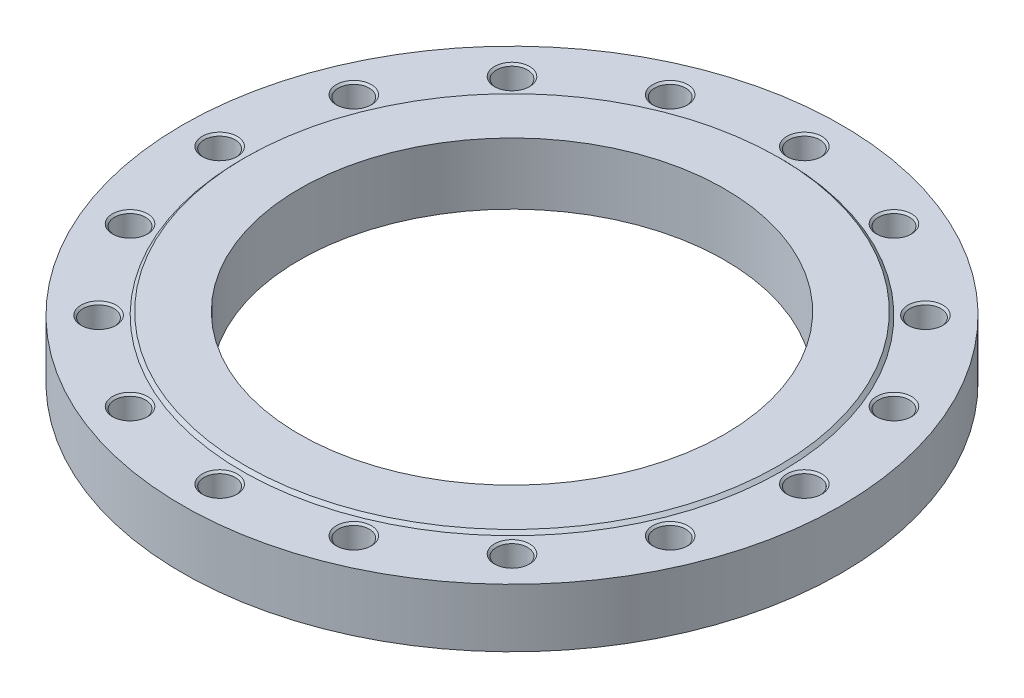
ISO-10303-21;
HEADER;
FILE_DESCRIPTION(('STEP AP214'),'2;1');
FILE_NAME('part.step','',(''),(''),'','','');
FILE_SCHEMA(('AUTOMOTIVE_DESIGN { 1 0 10303 214 1 1 1 1 }'));
ENDSEC;
DATA;
#1=APPLICATION_CONTEXT('core data for automotive mechanical design processes');
#2=APPLICATION_PROTOCOL_DEFINITION('international standard','automotive_design',2000,#1);
#3=PRODUCT_CONTEXT('',#1,'mechanical');
#4=PRODUCT('Part','Part','',(#3));
#5=PRODUCT_RELATED_PRODUCT_CATEGORY('part','',(#4));
#6=PRODUCT_DEFINITION_FORMATION('','',#4);
#7=PRODUCT_DEFINITION_CONTEXT('part definition',#1,'design');
#8=PRODUCT_DEFINITION('design','',#6,#7);
#9=PRODUCT_DEFINITION_SHAPE('','',#8);
#10=(LENGTH_UNIT() NAMED_UNIT(*) SI_UNIT(.MILLI.,.METRE.));
#11=(NAMED_UNIT(*) PLANE_ANGLE_UNIT() SI_UNIT($,.RADIAN.));
#12=(NAMED_UNIT(*) SI_UNIT($,.STERADIAN.) SOLID_ANGLE_UNIT());
#13=UNCERTAINTY_MEASURE_WITH_UNIT(LENGTH_MEASURE(1.E-05),#10,'distance_accuracy_value','');
#14=(GEOMETRIC_REPRESENTATION_CONTEXT(3) GLOBAL_UNCERTAINTY_ASSIGNED_CONTEXT((#13)) GLOBAL_UNIT_ASSIGNED_CONTEXT((#10,
#11,#12)) REPRESENTATION_CONTEXT('',''));
#15=CARTESIAN_POINT('',(0.,0.,0.));
#16=DIRECTION('',(0.,0.,1.));
#17=DIRECTION('',(1.,0.,0.));
#18=AXIS2_PLACEMENT_3D('',#15,#16,#17);
#19=CARTESIAN_POINT('',(0.,27.5,0.));
#20=DIRECTION('',(0.,-1.,0.));
#21=DIRECTION('',(1.,0.,0.));
#22=AXIS2_PLACEMENT_3D('',#19,#20,#21);
#23=CYLINDRICAL_SURFACE('',#22,310.);
#24=CARTESIAN_POINT('',(0.,0.,0.));
#25=DIRECTION('',(0.,1.,0.));
#26=DIRECTION('',(1.,0.,0.));
#27=AXIS2_PLACEMENT_3D('',#24,#25,#26);
#28=CIRCLE('',#27,310.);
#29=CARTESIAN_POINT('',(310.,0.,0.));
#30=VERTEX_POINT('',#29);
#31=EDGE_CURVE('E9',#30,#30,#28,.T.);
#32=ORIENTED_EDGE('',*,*,#31,.T.);
#33=EDGE_LOOP('',(#32));
#34=FACE_BOUND('',#33,.T.);
#35=CARTESIAN_POINT('',(0.,55.,0.));
#36=DIRECTION('',(0.,1.,0.));
#37=DIRECTION('',(1.,0.,0.));
#38=AXIS2_PLACEMENT_3D('',#35,#36,#37);
#39=CIRCLE('',#38,310.);
#40=CARTESIAN_POINT('',(310.,55.,0.));
#41=VERTEX_POINT('',#40);
#42=EDGE_CURVE('E274',#41,#41,#39,.T.);
#43=ORIENTED_EDGE('',*,*,#42,.F.);
#44=EDGE_LOOP('',(#43));
#45=FACE_BOUND('',#44,.T.);
#46=ADVANCED_FACE('F15',(#34,#45),#23,.T.);
#47=CARTESIAN_POINT('',(255.,0.,0.));
#48=DIRECTION('',(0.,-1.,0.));
#49=DIRECTION('',(-1.,0.,0.));
#50=AXIS2_PLACEMENT_3D('',#47,#48,#49);
#51=PLANE('',#50);
#52=CARTESIAN_POINT('',(0.,0.,0.));
#53=DIRECTION('',(0.,1.,0.));
#54=DIRECTION('',(1.,0.,0.));
#55=AXIS2_PLACEMENT_3D('',#52,#53,#54);
#56=CIRCLE('',#55,200.);
#57=CARTESIAN_POINT('',(200.,0.,0.));
#58=VERTEX_POINT('',#57);
#59=EDGE_CURVE('E23',#58,#58,#56,.T.);
#60=ORIENTED_EDGE('',*,*,#59,.T.);
#61=EDGE_LOOP('',(#60));
#62=FACE_BOUND('',#61,.T.);
#63=ORIENTED_EDGE('',*,*,#31,.F.);
#64=EDGE_LOOP('',(#63));
#65=FACE_BOUND('',#64,.T.);
#66=ADVANCED_FACE('F634',(#62,#65),#51,.T.);
#67=CARTESIAN_POINT('',(0.,29.,0.));
#68=DIRECTION('',(0.,-1.,0.));
#69=DIRECTION('',(1.,0.,0.));
#70=AXIS2_PLACEMENT_3D('',#67,#68,#69);
#71=CYLINDRICAL_SURFACE('',#70,200.);
#72=CARTESIAN_POINT('',(0.,58.,0.));
#73=DIRECTION('',(0.,1.,0.));
#74=DIRECTION('',(1.,0.,0.));
#75=AXIS2_PLACEMENT_3D('',#72,#73,#74);
#76=CIRCLE('',#75,200.);
#77=CARTESIAN_POINT('',(200.,58.,0.));
#78=VERTEX_POINT('',#77);
#79=EDGE_CURVE('E428',#78,#78,#76,.T.);
#80=ORIENTED_EDGE('',*,*,#79,.T.);
#81=EDGE_LOOP('',(#80));
#82=FACE_BOUND('',#81,.T.);
#83=ORIENTED_EDGE('',*,*,#59,.F.);
#84=EDGE_LOOP('',(#83));
#85=FACE_BOUND('',#84,.T.);
#86=ADVANCED_FACE('F638',(#82,#85),#71,.F.);
#87=CARTESIAN_POINT('',(225.5,58.,0.));
#88=DIRECTION('',(0.,1.,0.));
#89=DIRECTION('',(1.,0.,0.));
#90=AXIS2_PLACEMENT_3D('',#87,#88,#89);
#91=PLANE('',#90);
#92=CARTESIAN_POINT('',(0.,58.,0.));
#93=DIRECTION('',(0.,1.,0.));
#94=DIRECTION('',(1.,0.,0.));
#95=AXIS2_PLACEMENT_3D('',#92,#93,#94);
#96=CIRCLE('',#95,251.);
#97=CARTESIAN_POINT('',(251.,58.,0.));
#98=VERTEX_POINT('',#97);
#99=EDGE_CURVE('E427',#98,#98,#96,.T.);
#100=ORIENTED_EDGE('',*,*,#99,.T.);
#101=EDGE_LOOP('',(#100));
#102=FACE_BOUND('',#101,.T.);
#103=ORIENTED_EDGE('',*,*,#79,.F.);
#104=EDGE_LOOP('',(#103));
#105=FACE_BOUND('',#104,.T.);
#106=ADVANCED_FACE('F643',(#102,#105),#91,.T.);
#107=CARTESIAN_POINT('',(0.,56.5,0.));
#108=DIRECTION('',(0.,-1.,0.));
#109=DIRECTION('',(1.,0.,0.));
#110=AXIS2_PLACEMENT_3D('',#107,#108,#109);
#111=CONICAL_SURFACE('',#110,252.5,0.785398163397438);
#112=CARTESIAN_POINT('',(0.,55.,0.));
#113=DIRECTION('',(0.,1.,0.));
#114=DIRECTION('',(1.,0.,0.));
#115=AXIS2_PLACEMENT_3D('',#112,#113,#114);
#116=CIRCLE('',#115,254.);
#117=CARTESIAN_POINT('',(254.,55.,0.));
#118=VERTEX_POINT('',#117);
#119=EDGE_CURVE('E281',#118,#118,#116,.T.);
#120=ORIENTED_EDGE('',*,*,#119,.T.);
#121=EDGE_LOOP('',(#120));
#122=FACE_BOUND('',#121,.T.);
#123=ORIENTED_EDGE('',*,*,#99,.F.);
#124=EDGE_LOOP('',(#123));
#125=FACE_BOUND('',#124,.T.);
#126=ADVANCED_FACE('F649',(#122,#125),#111,.T.);
#127=CARTESIAN_POINT('',(282.,55.,0.));
#128=DIRECTION('',(0.,1.,0.));
#129=DIRECTION('',(1.,0.,0.));
#130=AXIS2_PLACEMENT_3D('',#127,#128,#129);
#131=PLANE('',#130);
#132=ORIENTED_EDGE('',*,*,#42,.T.);
#133=EDGE_LOOP('',(#132));
#134=FACE_BOUND('',#133,.T.);
#135=ORIENTED_EDGE('',*,*,#119,.F.);
#136=EDGE_LOOP('',(#135));
#137=FACE_BOUND('',#136,.T.);
#138=CARTESIAN_POINT('',(275.,55.,0.));
#139=DIRECTION('',(0.,-1.,0.));
#140=DIRECTION('',(1.,0.,0.));
#141=AXIS2_PLACEMENT_3D('',#138,#139,#140);
#142=CIRCLE('',#141,16.5);
#143=CARTESIAN_POINT('',(291.5,55.,0.));
#144=VERTEX_POINT('',#143);
#145=EDGE_CURVE('E416',#144,#144,#142,.T.);
#146=ORIENTED_EDGE('',*,*,#145,.T.);
#147=EDGE_LOOP('',(#146));
#148=FACE_BOUND('',#147,.T.);
#149=CARTESIAN_POINT('',(254.066871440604,55.,-105.2379439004));
#150=DIRECTION('',(0.,-1.,0.));
#151=DIRECTION('',(0.923879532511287,0.,-0.38268343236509));
#152=AXIS2_PLACEMENT_3D('',#149,#150,#151);
#153=CIRCLE('',#152,16.5);
#154=CARTESIAN_POINT('',(269.31088372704,55.,-111.552220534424));
#155=VERTEX_POINT('',#154);
#156=EDGE_CURVE('E354',#155,#155,#153,.T.);
#157=ORIENTED_EDGE('',*,*,#156,.T.);
#158=EDGE_LOOP('',(#157));
#159=FACE_BOUND('',#158,.T.);
#160=CARTESIAN_POINT('',(194.4543648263,55.,-194.4543648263));
#161=DIRECTION('',(0.,-1.,0.));
#162=DIRECTION('',(0.707106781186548,0.,-0.707106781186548));
#163=AXIS2_PLACEMENT_3D('',#160,#161,#162);
#164=CIRCLE('',#163,16.5);
#165=CARTESIAN_POINT('',(206.121626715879,55.,-206.121626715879));
#166=VERTEX_POINT('',#165);
#167=EDGE_CURVE('E336',#166,#166,#164,.T.);
#168=ORIENTED_EDGE('',*,*,#167,.T.);
#169=EDGE_LOOP('',(#168));
#170=FACE_BOUND('',#169,.T.);
#171=CARTESIAN_POINT('',(105.2379439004,55.,-254.066871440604));
#172=DIRECTION('',(0.,-1.,0.));
#173=DIRECTION('',(0.38268343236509,0.,-0.923879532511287));
#174=AXIS2_PLACEMENT_3D('',#171,#172,#173);
#175=CIRCLE('',#174,16.5);
#176=CARTESIAN_POINT('',(111.552220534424,55.,-269.31088372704));
#177=VERTEX_POINT('',#176);
#178=EDGE_CURVE('E327',#177,#177,#175,.T.);
#179=ORIENTED_EDGE('',*,*,#178,.T.);
#180=EDGE_LOOP('',(#179));
#181=FACE_BOUND('',#180,.T.);
#182=CARTESIAN_POINT('',(0.,55.,-275.));
#183=DIRECTION('',(0.,-1.,0.));
#184=DIRECTION('',(0.,0.,-1.));
#185=AXIS2_PLACEMENT_3D('',#182,#183,#184);
#186=CIRCLE('',#185,16.5);
#187=CARTESIAN_POINT('',(0.,55.,-291.5));
#188=VERTEX_POINT('',#187);
#189=EDGE_CURVE('E396',#188,#188,#186,.T.);
#190=ORIENTED_EDGE('',*,*,#189,.T.);
#191=EDGE_LOOP('',(#190));
#192=FACE_BOUND('',#191,.T.);
#193=CARTESIAN_POINT('',(-105.2379439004,55.,-254.066871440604));
#194=DIRECTION('',(0.,-1.,0.));
#195=DIRECTION('',(-0.38268343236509,0.,-0.923879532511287));
#196=AXIS2_PLACEMENT_3D('',#193,#194,#195);
#197=CIRCLE('',#196,16.5);
#198=CARTESIAN_POINT('',(-111.552220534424,55.,-269.31088372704));
#199=VERTEX_POINT('',#198);
#200=EDGE_CURVE('E380',#199,#199,#197,.T.);
#201=ORIENTED_EDGE('',*,*,#200,.T.);
#202=EDGE_LOOP('',(#201));
#203=FACE_BOUND('',#202,.T.);
#204=CARTESIAN_POINT('',(-194.4543648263,55.,-194.4543648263));
#205=DIRECTION('',(0.,-1.,0.));
#206=DIRECTION('',(-0.707106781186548,0.,-0.707106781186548));
#207=AXIS2_PLACEMENT_3D('',#204,#205,#206);
#208=CIRCLE('',#207,16.5);
#209=CARTESIAN_POINT('',(-206.121626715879,55.,-206.121626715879));
#210=VERTEX_POINT('',#209);
#211=EDGE_CURVE('E367',#210,#210,#208,.T.);
#212=ORIENTED_EDGE('',*,*,#211,.T.);
#213=EDGE_LOOP('',(#212));
#214=FACE_BOUND('',#213,.T.);
#215=CARTESIAN_POINT('',(-254.066871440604,55.,-105.2379439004));
#216=DIRECTION('',(0.,-1.,0.));
#217=DIRECTION('',(-0.923879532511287,0.,-0.38268343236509));
#218=AXIS2_PLACEMENT_3D('',#215,#216,#217);
#219=CIRCLE('',#218,16.5);
#220=CARTESIAN_POINT('',(-269.31088372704,55.,-111.552220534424));
#221=VERTEX_POINT('',#220);
#222=EDGE_CURVE('E339',#221,#221,#219,.T.);
#223=ORIENTED_EDGE('',*,*,#222,.T.);
#224=EDGE_LOOP('',(#223));
#225=FACE_BOUND('',#224,.T.);
#226=CARTESIAN_POINT('',(-275.,55.,0.));
#227=DIRECTION('',(0.,-1.,0.));
#228=DIRECTION('',(-1.,0.,0.));
#229=AXIS2_PLACEMENT_3D('',#226,#227,#228);
#230=CIRCLE('',#229,16.5);
#231=CARTESIAN_POINT('',(-291.5,55.,0.));
#232=VERTEX_POINT('',#231);
#233=EDGE_CURVE('E313',#232,#232,#230,.T.);
#234=ORIENTED_EDGE('',*,*,#233,.T.);
#235=EDGE_LOOP('',(#234));
#236=FACE_BOUND('',#235,.T.);
#237=CARTESIAN_POINT('',(-254.066871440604,55.,105.2379439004));
#238=DIRECTION('',(0.,-1.,0.));
#239=DIRECTION('',(-0.923879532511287,0.,0.38268343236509));
#240=AXIS2_PLACEMENT_3D('',#237,#238,#239);
#241=CIRCLE('',#240,16.5);
#242=CARTESIAN_POINT('',(-269.31088372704,55.,111.552220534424));
#243=VERTEX_POINT('',#242);
#244=EDGE_CURVE('E458',#243,#243,#241,.T.);
#245=ORIENTED_EDGE('',*,*,#244,.T.);
#246=EDGE_LOOP('',(#245));
#247=FACE_BOUND('',#246,.T.);
#248=CARTESIAN_POINT('',(-194.4543648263,55.,194.4543648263));
#249=DIRECTION('',(0.,-1.,0.));
#250=DIRECTION('',(-0.707106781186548,0.,0.707106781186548));
#251=AXIS2_PLACEMENT_3D('',#248,#249,#250);
#252=CIRCLE('',#251,16.5);
#253=CARTESIAN_POINT('',(-206.121626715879,55.,206.121626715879));
#254=VERTEX_POINT('',#253);
#255=EDGE_CURVE('E444',#254,#254,#252,.T.);
#256=ORIENTED_EDGE('',*,*,#255,.T.);
#257=EDGE_LOOP('',(#256));
#258=FACE_BOUND('',#257,.T.);
#259=CARTESIAN_POINT('',(-105.2379439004,55.,254.066871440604));
#260=DIRECTION('',(0.,-1.,0.));
#261=DIRECTION('',(-0.382683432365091,0.,0.923879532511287));
#262=AXIS2_PLACEMENT_3D('',#259,#260,#261);
#263=CIRCLE('',#262,16.5);
#264=CARTESIAN_POINT('',(-111.552220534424,55.,269.31088372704));
#265=VERTEX_POINT('',#264);
#266=EDGE_CURVE('E470',#265,#265,#263,.T.);
#267=ORIENTED_EDGE('',*,*,#266,.T.);
#268=EDGE_LOOP('',(#267));
#269=FACE_BOUND('',#268,.T.);
#270=CARTESIAN_POINT('',(0.,55.,275.));
#271=DIRECTION('',(0.,-1.,0.));
#272=DIRECTION('',(0.,0.,1.));
#273=AXIS2_PLACEMENT_3D('',#270,#271,#272);
#274=CIRCLE('',#273,16.5);
#275=CARTESIAN_POINT('',(0.,55.,291.5));
#276=VERTEX_POINT('',#275);
#277=EDGE_CURVE('E484',#276,#276,#274,.T.);
#278=ORIENTED_EDGE('',*,*,#277,.T.);
#279=EDGE_LOOP('',(#278));
#280=FACE_BOUND('',#279,.T.);
#281=CARTESIAN_POINT('',(105.2379439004,55.,254.066871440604));
#282=DIRECTION('',(0.,-1.,0.));
#283=DIRECTION('',(0.38268343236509,0.,0.923879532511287));
#284=AXIS2_PLACEMENT_3D('',#281,#282,#283);
#285=CIRCLE('',#284,16.5);
#286=CARTESIAN_POINT('',(111.552220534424,55.,269.31088372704));
#287=VERTEX_POINT('',#286);
#288=EDGE_CURVE('E500',#287,#287,#285,.T.);
#289=ORIENTED_EDGE('',*,*,#288,.T.);
#290=EDGE_LOOP('',(#289));
#291=FACE_BOUND('',#290,.T.);
#292=CARTESIAN_POINT('',(194.4543648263,55.,194.4543648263));
#293=DIRECTION('',(0.,-1.,0.));
#294=DIRECTION('',(0.707106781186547,0.,0.707106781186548));
#295=AXIS2_PLACEMENT_3D('',#292,#293,#294);
#296=CIRCLE('',#295,16.5);
#297=CARTESIAN_POINT('',(206.121626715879,55.,206.121626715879));
#298=VERTEX_POINT('',#297);
#299=EDGE_CURVE('E513',#298,#298,#296,.T.);
#300=ORIENTED_EDGE('',*,*,#299,.T.);
#301=EDGE_LOOP('',(#300));
#302=FACE_BOUND('',#301,.T.);
#303=CARTESIAN_POINT('',(254.066871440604,55.,105.2379439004));
#304=DIRECTION('',(0.,-1.,0.));
#305=DIRECTION('',(0.923879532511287,0.,0.382683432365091));
#306=AXIS2_PLACEMENT_3D('',#303,#304,#305);
#307=CIRCLE('',#306,16.5);
#308=CARTESIAN_POINT('',(269.31088372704,55.,111.552220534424));
#309=VERTEX_POINT('',#308);
#310=EDGE_CURVE('E527',#309,#309,#307,.T.);
#311=ORIENTED_EDGE('',*,*,#310,.T.);
#312=EDGE_LOOP('',(#311));
#313=FACE_BOUND('',#312,.T.);
#314=ADVANCED_FACE('F546',(#134,#137,#148,#159,#170,#181,#192,#203,#214,#225,#236,#247,#258,
#269,#280,#291,#302,#313),#131,.T.);
#315=CARTESIAN_POINT('',(275.,7.78371923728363,0.));
#316=DIRECTION('',(0.,1.,0.));
#317=DIRECTION('',(1.,0.,0.));
#318=AXIS2_PLACEMENT_3D('',#315,#316,#317);
#319=CONICAL_SURFACE('',#318,7.3028125,1.0471975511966);
#320=CARTESIAN_POINT('',(275.,12.,0.));
#321=DIRECTION('',(0.,-1.,0.));
#322=DIRECTION('',(1.,0.,0.));
#323=AXIS2_PLACEMENT_3D('',#320,#321,#322);
#324=CIRCLE('',#323,14.605625);
#325=CARTESIAN_POINT('',(289.605625,12.,0.));
#326=VERTEX_POINT('',#325);
#327=EDGE_CURVE('E424',#326,#326,#324,.T.);
#328=ORIENTED_EDGE('',*,*,#327,.F.);
#329=EDGE_LOOP('',(#328));
#330=FACE_BOUND('',#329,.T.);
#331=CARTESIAN_POINT('',(275.,3.56743847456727,0.));
#332=VERTEX_POINT('',#331);
#333=VERTEX_LOOP('',#332);
#334=FACE_BOUND('',#333,.T.);
#335=ADVANCED_FACE('F653',(#330,#334),#319,.F.);
#336=CARTESIAN_POINT('',(275.,16.5528125,0.));
#337=DIRECTION('',(0.,1.,0.));
#338=DIRECTION('',(1.,0.,0.));
#339=AXIS2_PLACEMENT_3D('',#336,#337,#338);
#340=CYLINDRICAL_SURFACE('',#339,14.605625);
#341=CARTESIAN_POINT('',(275.,21.105625,0.));
#342=DIRECTION('',(0.,-1.,0.));
#343=DIRECTION('',(1.,0.,0.));
#344=AXIS2_PLACEMENT_3D('',#341,#342,#343);
#345=CIRCLE('',#344,14.605625);
#346=CARTESIAN_POINT('',(289.605625,21.105625,0.));
#347=VERTEX_POINT('',#346);
#348=EDGE_CURVE('E422',#347,#347,#345,.T.);
#349=ORIENTED_EDGE('',*,*,#348,.F.);
#350=EDGE_LOOP('',(#349));
#351=FACE_BOUND('',#350,.T.);
#352=ORIENTED_EDGE('',*,*,#327,.T.);
#353=EDGE_LOOP('',(#352));
#354=FACE_BOUND('',#353,.T.);
#355=ADVANCED_FACE('F656',(#351,#354),#340,.F.);
#356=CARTESIAN_POINT('',(275.,22.0528125,0.));
#357=DIRECTION('',(0.,1.,0.));
#358=DIRECTION('',(1.,0.,0.));
#359=AXIS2_PLACEMENT_3D('',#356,#357,#358);
#360=CONICAL_SURFACE('',#359,15.5528125,0.785398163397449);
#361=CARTESIAN_POINT('',(275.,23.,0.));
#362=DIRECTION('',(0.,-1.,0.));
#363=DIRECTION('',(1.,0.,0.));
#364=AXIS2_PLACEMENT_3D('',#361,#362,#363);
#365=CIRCLE('',#364,16.5);
#366=CARTESIAN_POINT('',(291.5,23.,0.));
#367=VERTEX_POINT('',#366);
#368=EDGE_CURVE('E420',#367,#367,#365,.T.);
#369=ORIENTED_EDGE('',*,*,#368,.F.);
#370=EDGE_LOOP('',(#369));
#371=FACE_BOUND('',#370,.T.);
#372=ORIENTED_EDGE('',*,*,#348,.T.);
#373=EDGE_LOOP('',(#372));
#374=FACE_BOUND('',#373,.T.);
#375=ADVANCED_FACE('F660',(#371,#374),#360,.F.);
#376=CARTESIAN_POINT('',(290.5528125,23.,0.));
#377=DIRECTION('',(0.,1.,0.));
#378=DIRECTION('',(-1.,0.,0.));
#379=AXIS2_PLACEMENT_3D('',#376,#377,#378);
#380=PLANE('',#379);
#381=CARTESIAN_POINT('',(275.,23.,0.));
#382=DIRECTION('',(0.,-1.,0.));
#383=DIRECTION('',(1.,0.,0.));
#384=AXIS2_PLACEMENT_3D('',#381,#382,#383);
#385=CIRCLE('',#384,14.605625);
#386=CARTESIAN_POINT('',(289.605625,23.,0.));
#387=VERTEX_POINT('',#386);
#388=EDGE_CURVE('E418',#387,#387,#385,.T.);
#389=ORIENTED_EDGE('',*,*,#388,.F.);
#390=EDGE_LOOP('',(#389));
#391=FACE_BOUND('',#390,.T.);
#392=ORIENTED_EDGE('',*,*,#368,.T.);
#393=EDGE_LOOP('',(#392));
#394=FACE_BOUND('',#393,.T.);
#395=ADVANCED_FACE('F664',(#391,#394),#380,.F.);
#396=CARTESIAN_POINT('',(275.,38.0528125,0.));
#397=DIRECTION('',(0.,1.,0.));
#398=DIRECTION('',(1.,0.,0.));
#399=AXIS2_PLACEMENT_3D('',#396,#397,#398);
#400=CYLINDRICAL_SURFACE('',#399,14.605625);
#401=CARTESIAN_POINT('',(275.,53.105625,0.));
#402=DIRECTION('',(0.,-1.,0.));
#403=DIRECTION('',(1.,0.,0.));
#404=AXIS2_PLACEMENT_3D('',#401,#402,#403);
#405=CIRCLE('',#404,14.605625);
#406=CARTESIAN_POINT('',(289.605625,53.105625,0.));
#407=VERTEX_POINT('',#406);
#408=EDGE_CURVE('E414',#407,#407,#405,.T.);
#409=ORIENTED_EDGE('',*,*,#408,.F.);
#410=EDGE_LOOP('',(#409));
#411=FACE_BOUND('',#410,.T.);
#412=ORIENTED_EDGE('',*,*,#388,.T.);
#413=EDGE_LOOP('',(#412));
#414=FACE_BOUND('',#413,.T.);
#415=ADVANCED_FACE('F666',(#411,#414),#400,.F.);
#416=CARTESIAN_POINT('',(275.,54.0528125,0.));
#417=DIRECTION('',(0.,1.,0.));
#418=DIRECTION('',(1.,0.,0.));
#419=AXIS2_PLACEMENT_3D('',#416,#417,#418);
#420=CONICAL_SURFACE('',#419,15.5528125,0.785398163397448);
#421=ORIENTED_EDGE('',*,*,#145,.F.);
#422=EDGE_LOOP('',(#421));
#423=FACE_BOUND('',#422,.T.);
#424=ORIENTED_EDGE('',*,*,#408,.T.);
#425=EDGE_LOOP('',(#424));
#426=FACE_BOUND('',#425,.T.);
#427=ADVANCED_FACE('F669',(#423,#426),#420,.F.);
#428=CARTESIAN_POINT('',(254.066871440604,7.78371923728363,-105.2379439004));
#429=DIRECTION('',(0.,1.,0.));
#430=DIRECTION('',(0.923879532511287,0.,-0.38268343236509));
#431=AXIS2_PLACEMENT_3D('',#428,#429,#430);
#432=CONICAL_SURFACE('',#431,7.3028125,1.0471975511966);
#433=CARTESIAN_POINT('',(254.066871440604,12.,-105.2379439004));
#434=DIRECTION('',(0.,-1.,0.));
#435=DIRECTION('',(0.923879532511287,0.,-0.38268343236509));
#436=AXIS2_PLACEMENT_3D('',#433,#434,#435);
#437=CIRCLE('',#436,14.605625);
#438=CARTESIAN_POINT('',(267.560709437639,12.,-110.827274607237));
#439=VERTEX_POINT('',#438);
#440=EDGE_CURVE('E412',#439,#439,#437,.T.);
#441=ORIENTED_EDGE('',*,*,#440,.F.);
#442=EDGE_LOOP('',(#441));
#443=FACE_BOUND('',#442,.T.);
#444=CARTESIAN_POINT('',(254.066871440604,3.56743847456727,-105.2379439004));
#445=VERTEX_POINT('',#444);
#446=VERTEX_LOOP('',#445);
#447=FACE_BOUND('',#446,.T.);
#448=ADVANCED_FACE('F673',(#443,#447),#432,.F.);
#449=CARTESIAN_POINT('',(254.066871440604,16.5528125,-105.2379439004));
#450=DIRECTION('',(0.,1.,0.));
#451=DIRECTION('',(0.923879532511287,0.,-0.38268343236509));
#452=AXIS2_PLACEMENT_3D('',#449,#450,#451);
#453=CYLINDRICAL_SURFACE('',#452,14.605625);
#454=CARTESIAN_POINT('',(254.066871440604,21.105625,-105.2379439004));
#455=DIRECTION('',(0.,-1.,0.));
#456=DIRECTION('',(0.923879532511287,0.,-0.38268343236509));
#457=AXIS2_PLACEMENT_3D('',#454,#455,#456);
#458=CIRCLE('',#457,14.605625);
#459=CARTESIAN_POINT('',(267.560709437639,21.105625,-110.827274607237));
#460=VERTEX_POINT('',#459);
#461=EDGE_CURVE('E410',#460,#460,#458,.T.);
#462=ORIENTED_EDGE('',*,*,#461,.F.);
#463=EDGE_LOOP('',(#462));
#464=FACE_BOUND('',#463,.T.);
#465=ORIENTED_EDGE('',*,*,#440,.T.);
#466=EDGE_LOOP('',(#465));
#467=FACE_BOUND('',#466,.T.);
#468=ADVANCED_FACE('F677',(#464,#467),#453,.F.);
#469=CARTESIAN_POINT('',(254.066871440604,22.0528125,-105.2379439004));
#470=DIRECTION('',(0.,1.,0.));
#471=DIRECTION('',(0.923879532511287,0.,-0.38268343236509));
#472=AXIS2_PLACEMENT_3D('',#469,#470,#471);
#473=CONICAL_SURFACE('',#472,15.5528125,0.785398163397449);
#474=CARTESIAN_POINT('',(254.066871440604,23.,-105.2379439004));
#475=DIRECTION('',(0.,-1.,0.));
#476=DIRECTION('',(0.923879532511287,0.,-0.38268343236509));
#477=AXIS2_PLACEMENT_3D('',#474,#475,#476);
#478=CIRCLE('',#477,16.5);
#479=CARTESIAN_POINT('',(269.31088372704,23.,-111.552220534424));
#480=VERTEX_POINT('',#479);
#481=EDGE_CURVE('E353',#480,#480,#478,.T.);
#482=ORIENTED_EDGE('',*,*,#481,.F.);
#483=EDGE_LOOP('',(#482));
#484=FACE_BOUND('',#483,.T.);
#485=ORIENTED_EDGE('',*,*,#461,.T.);
#486=EDGE_LOOP('',(#485));
#487=FACE_BOUND('',#486,.T.);
#488=ADVANCED_FACE('F681',(#484,#487),#473,.F.);
#489=CARTESIAN_POINT('',(268.435796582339,23.,-111.18974757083));
#490=DIRECTION('',(0.,1.,0.));
#491=DIRECTION('',(-0.923879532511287,0.,0.38268343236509));
#492=AXIS2_PLACEMENT_3D('',#489,#490,#491);
#493=PLANE('',#492);
#494=CARTESIAN_POINT('',(254.066871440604,23.,-105.2379439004));
#495=DIRECTION('',(0.,-1.,0.));
#496=DIRECTION('',(0.923879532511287,0.,-0.38268343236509));
#497=AXIS2_PLACEMENT_3D('',#494,#495,#496);
#498=CIRCLE('',#497,14.605625);
#499=CARTESIAN_POINT('',(267.560709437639,23.,-110.827274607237));
#500=VERTEX_POINT('',#499);
#501=EDGE_CURVE('E351',#500,#500,#498,.T.);
#502=ORIENTED_EDGE('',*,*,#501,.F.);
#503=EDGE_LOOP('',(#502));
#504=FACE_BOUND('',#503,.T.);
#505=ORIENTED_EDGE('',*,*,#481,.T.);
#506=EDGE_LOOP('',(#505));
#507=FACE_BOUND('',#506,.T.);
#508=ADVANCED_FACE('F685',(#504,#507),#493,.F.);
#509=CARTESIAN_POINT('',(254.066871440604,38.0528125,-105.2379439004));
#510=DIRECTION('',(0.,1.,0.));
#511=DIRECTION('',(0.923879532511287,0.,-0.38268343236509));
#512=AXIS2_PLACEMENT_3D('',#509,#510,#511);
#513=CYLINDRICAL_SURFACE('',#512,14.605625);
#514=CARTESIAN_POINT('',(254.066871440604,53.105625,-105.2379439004));
#515=DIRECTION('',(0.,-1.,0.));
#516=DIRECTION('',(0.923879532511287,0.,-0.38268343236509));
#517=AXIS2_PLACEMENT_3D('',#514,#515,#516);
#518=CIRCLE('',#517,14.605625);
#519=CARTESIAN_POINT('',(267.560709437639,53.105625,-110.827274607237));
#520=VERTEX_POINT('',#519);
#521=EDGE_CURVE('E362',#520,#520,#518,.T.);
#522=ORIENTED_EDGE('',*,*,#521,.F.);
#523=EDGE_LOOP('',(#522));
#524=FACE_BOUND('',#523,.T.);
#525=ORIENTED_EDGE('',*,*,#501,.T.);
#526=EDGE_LOOP('',(#525));
#527=FACE_BOUND('',#526,.T.);
#528=ADVANCED_FACE('F689',(#524,#527),#513,.F.);
#529=CARTESIAN_POINT('',(254.066871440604,54.0528125,-105.2379439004));
#530=DIRECTION('',(0.,1.,0.));
#531=DIRECTION('',(0.923879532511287,0.,-0.38268343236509));
#532=AXIS2_PLACEMENT_3D('',#529,#530,#531);
#533=CONICAL_SURFACE('',#532,15.5528125,0.785398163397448);
#534=ORIENTED_EDGE('',*,*,#156,.F.);
#535=EDGE_LOOP('',(#534));
#536=FACE_BOUND('',#535,.T.);
#537=ORIENTED_EDGE('',*,*,#521,.T.);
#538=EDGE_LOOP('',(#537));
#539=FACE_BOUND('',#538,.T.);
#540=ADVANCED_FACE('F693',(#536,#539),#533,.F.);
#541=CARTESIAN_POINT('',(194.4543648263,7.78371923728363,-194.4543648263));
#542=DIRECTION('',(0.,1.,0.));
#543=DIRECTION('',(0.707106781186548,0.,-0.707106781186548));
#544=AXIS2_PLACEMENT_3D('',#541,#542,#543);
#545=CONICAL_SURFACE('',#544,7.3028125,1.0471975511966);
#546=CARTESIAN_POINT('',(194.4543648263,12.,-194.4543648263));
#547=DIRECTION('',(0.,-1.,0.));
#548=DIRECTION('',(0.707106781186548,0.,-0.707106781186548));
#549=AXIS2_PLACEMENT_3D('',#546,#547,#548);
#550=CIRCLE('',#549,14.605625);
#551=CARTESIAN_POINT('',(204.782101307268,12.,-204.782101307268));
#552=VERTEX_POINT('',#551);
#553=EDGE_CURVE('E360',#552,#552,#550,.T.);
#554=ORIENTED_EDGE('',*,*,#553,.F.);
#555=EDGE_LOOP('',(#554));
#556=FACE_BOUND('',#555,.T.);
#557=CARTESIAN_POINT('',(194.4543648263,3.56743847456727,-194.4543648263));
#558=VERTEX_POINT('',#557);
#559=VERTEX_LOOP('',#558);
#560=FACE_BOUND('',#559,.T.);
#561=ADVANCED_FACE('F697',(#556,#560),#545,.F.);
#562=CARTESIAN_POINT('',(194.4543648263,16.5528125,-194.4543648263));
#563=DIRECTION('',(0.,1.,0.));
#564=DIRECTION('',(0.707106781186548,0.,-0.707106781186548));
#565=AXIS2_PLACEMENT_3D('',#562,#563,#564);
#566=CYLINDRICAL_SURFACE('',#565,14.605625);
#567=CARTESIAN_POINT('',(194.4543648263,21.105625,-194.4543648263));
#568=DIRECTION('',(0.,-1.,0.));
#569=DIRECTION('',(0.707106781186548,0.,-0.707106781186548));
#570=AXIS2_PLACEMENT_3D('',#567,#568,#569);
#571=CIRCLE('',#570,14.605625);
#572=CARTESIAN_POINT('',(204.782101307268,21.105625,-204.782101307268));
#573=VERTEX_POINT('',#572);
#574=EDGE_CURVE('E363',#573,#573,#571,.T.);
#575=ORIENTED_EDGE('',*,*,#574,.F.);
#576=EDGE_LOOP('',(#575));
#577=FACE_BOUND('',#576,.T.);
#578=ORIENTED_EDGE('',*,*,#553,.T.);
#579=EDGE_LOOP('',(#578));
#580=FACE_BOUND('',#579,.T.);
#581=ADVANCED_FACE('F701',(#577,#580),#566,.F.);
#582=CARTESIAN_POINT('',(194.4543648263,22.0528125,-194.4543648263));
#583=DIRECTION('',(0.,1.,0.));
#584=DIRECTION('',(0.707106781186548,0.,-0.707106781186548));
#585=AXIS2_PLACEMENT_3D('',#582,#583,#584);
#586=CONICAL_SURFACE('',#585,15.5528125,0.785398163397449);
#587=CARTESIAN_POINT('',(194.4543648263,23.,-194.4543648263));
#588=DIRECTION('',(0.,-1.,0.));
#589=DIRECTION('',(0.707106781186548,0.,-0.707106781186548));
#590=AXIS2_PLACEMENT_3D('',#587,#588,#589);
#591=CIRCLE('',#590,16.5);
#592=CARTESIAN_POINT('',(206.121626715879,23.,-206.121626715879));
#593=VERTEX_POINT('',#592);
#594=EDGE_CURVE('E390',#593,#593,#591,.T.);
#595=ORIENTED_EDGE('',*,*,#594,.F.);
#596=EDGE_LOOP('',(#595));
#597=FACE_BOUND('',#596,.T.);
#598=ORIENTED_EDGE('',*,*,#574,.T.);
#599=EDGE_LOOP('',(#598));
#600=FACE_BOUND('',#599,.T.);
#601=ADVANCED_FACE('F707',(#597,#600),#586,.F.);
#602=CARTESIAN_POINT('',(205.451864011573,23.,-205.451864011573));
#603=DIRECTION('',(0.,1.,0.));
#604=DIRECTION('',(-0.707106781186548,0.,0.707106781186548));
#605=AXIS2_PLACEMENT_3D('',#602,#603,#604);
#606=PLANE('',#605);
#607=CARTESIAN_POINT('',(194.4543648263,23.,-194.4543648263));
#608=DIRECTION('',(0.,-1.,0.));
#609=DIRECTION('',(0.707106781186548,0.,-0.707106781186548));
#610=AXIS2_PLACEMENT_3D('',#607,#608,#609);
#611=CIRCLE('',#610,14.605625);
#612=CARTESIAN_POINT('',(204.782101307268,23.,-204.782101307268));
#613=VERTEX_POINT('',#612);
#614=EDGE_CURVE('E348',#613,#613,#611,.T.);
#615=ORIENTED_EDGE('',*,*,#614,.F.);
#616=EDGE_LOOP('',(#615));
#617=FACE_BOUND('',#616,.T.);
#618=ORIENTED_EDGE('',*,*,#594,.T.);
#619=EDGE_LOOP('',(#618));
#620=FACE_BOUND('',#619,.T.);
#621=ADVANCED_FACE('F703',(#617,#620),#606,.F.);
#622=CARTESIAN_POINT('',(194.4543648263,38.0528125,-194.4543648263));
#623=DIRECTION('',(0.,1.,0.));
#624=DIRECTION('',(0.707106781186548,0.,-0.707106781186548));
#625=AXIS2_PLACEMENT_3D('',#622,#623,#624);
#626=CYLINDRICAL_SURFACE('',#625,14.605625);
#627=CARTESIAN_POINT('',(194.4543648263,53.105625,-194.4543648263));
#628=DIRECTION('',(0.,-1.,0.));
#629=DIRECTION('',(0.707106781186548,0.,-0.707106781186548));
#630=AXIS2_PLACEMENT_3D('',#627,#628,#629);
#631=CIRCLE('',#630,14.605625);
#632=CARTESIAN_POINT('',(204.782101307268,53.105625,-204.782101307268));
#633=VERTEX_POINT('',#632);
#634=EDGE_CURVE('E334',#633,#633,#631,.T.);
#635=ORIENTED_EDGE('',*,*,#634,.F.);
#636=EDGE_LOOP('',(#635));
#637=FACE_BOUND('',#636,.T.);
#638=ORIENTED_EDGE('',*,*,#614,.T.);
#639=EDGE_LOOP('',(#638));
#640=FACE_BOUND('',#639,.T.);
#641=ADVANCED_FACE('F706',(#637,#640),#626,.F.);
#642=CARTESIAN_POINT('',(194.4543648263,54.0528125,-194.4543648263));
#643=DIRECTION('',(0.,1.,0.));
#644=DIRECTION('',(0.707106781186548,0.,-0.707106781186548));
#645=AXIS2_PLACEMENT_3D('',#642,#643,#644);
#646=CONICAL_SURFACE('',#645,15.5528125,0.785398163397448);
#647=ORIENTED_EDGE('',*,*,#167,.F.);
#648=EDGE_LOOP('',(#647));
#649=FACE_BOUND('',#648,.T.);
#650=ORIENTED_EDGE('',*,*,#634,.T.);
#651=EDGE_LOOP('',(#650));
#652=FACE_BOUND('',#651,.T.);
#653=ADVANCED_FACE('F711',(#649,#652),#646,.F.);
#654=CARTESIAN_POINT('',(105.2379439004,7.78371923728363,-254.066871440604));
#655=DIRECTION('',(0.,1.,0.));
#656=DIRECTION('',(0.38268343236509,0.,-0.923879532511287));
#657=AXIS2_PLACEMENT_3D('',#654,#655,#656);
#658=CONICAL_SURFACE('',#657,7.3028125,1.0471975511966);
#659=CARTESIAN_POINT('',(105.2379439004,12.,-254.066871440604));
#660=DIRECTION('',(0.,-1.,0.));
#661=DIRECTION('',(0.38268343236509,0.,-0.923879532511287));
#662=AXIS2_PLACEMENT_3D('',#659,#660,#661);
#663=CIRCLE('',#662,14.605625);
#664=CARTESIAN_POINT('',(110.827274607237,12.,-267.560709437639));
#665=VERTEX_POINT('',#664);
#666=EDGE_CURVE('E321',#665,#665,#663,.T.);
#667=ORIENTED_EDGE('',*,*,#666,.F.);
#668=EDGE_LOOP('',(#667));
#669=FACE_BOUND('',#668,.T.);
#670=CARTESIAN_POINT('',(105.2379439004,3.56743847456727,-254.066871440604));
#671=VERTEX_POINT('',#670);
#672=VERTEX_LOOP('',#671);
#673=FACE_BOUND('',#672,.T.);
#674=ADVANCED_FACE('F715',(#669,#673),#658,.F.);
#675=CARTESIAN_POINT('',(105.2379439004,16.5528125,-254.066871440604));
#676=DIRECTION('',(0.,1.,0.));
#677=DIRECTION('',(0.38268343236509,0.,-0.923879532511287));
#678=AXIS2_PLACEMENT_3D('',#675,#676,#677);
#679=CYLINDRICAL_SURFACE('',#678,14.605625);
#680=CARTESIAN_POINT('',(105.2379439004,21.105625,-254.066871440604));
#681=DIRECTION('',(0.,-1.,0.));
#682=DIRECTION('',(0.38268343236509,0.,-0.923879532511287));
#683=AXIS2_PLACEMENT_3D('',#680,#681,#682);
#684=CIRCLE('',#683,14.605625);
#685=CARTESIAN_POINT('',(110.827274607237,21.105625,-267.560709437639));
#686=VERTEX_POINT('',#685);
#687=EDGE_CURVE('E319',#686,#686,#684,.T.);
#688=ORIENTED_EDGE('',*,*,#687,.F.);
#689=EDGE_LOOP('',(#688));
#690=FACE_BOUND('',#689,.T.);
#691=ORIENTED_EDGE('',*,*,#666,.T.);
#692=EDGE_LOOP('',(#691));
#693=FACE_BOUND('',#692,.T.);
#694=ADVANCED_FACE('F717',(#690,#693),#679,.F.);
#695=CARTESIAN_POINT('',(105.2379439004,22.0528125,-254.066871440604));
#696=DIRECTION('',(0.,1.,0.));
#697=DIRECTION('',(0.38268343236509,0.,-0.923879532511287));
#698=AXIS2_PLACEMENT_3D('',#695,#696,#697);
#699=CONICAL_SURFACE('',#698,15.5528125,0.785398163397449);
#700=CARTESIAN_POINT('',(105.2379439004,23.,-254.066871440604));
#701=DIRECTION('',(0.,-1.,0.));
#702=DIRECTION('',(0.38268343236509,0.,-0.923879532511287));
#703=AXIS2_PLACEMENT_3D('',#700,#701,#702);
#704=CIRCLE('',#703,16.5);
#705=CARTESIAN_POINT('',(111.552220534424,23.,-269.31088372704));
#706=VERTEX_POINT('',#705);
#707=EDGE_CURVE('E322',#706,#706,#704,.T.);
#708=ORIENTED_EDGE('',*,*,#707,.F.);
#709=EDGE_LOOP('',(#708));
#710=FACE_BOUND('',#709,.T.);
#711=ORIENTED_EDGE('',*,*,#687,.T.);
#712=EDGE_LOOP('',(#711));
#713=FACE_BOUND('',#712,.T.);
#714=ADVANCED_FACE('F720',(#710,#713),#699,.F.);
#715=CARTESIAN_POINT('',(111.18974757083,23.,-268.435796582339));
#716=DIRECTION('',(0.,1.,0.));
#717=DIRECTION('',(-0.38268343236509,0.,0.923879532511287));
#718=AXIS2_PLACEMENT_3D('',#715,#716,#717);
#719=PLANE('',#718);
#720=CARTESIAN_POINT('',(105.2379439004,23.,-254.066871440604));
#721=DIRECTION('',(0.,-1.,0.));
#722=DIRECTION('',(0.38268343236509,0.,-0.923879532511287));
#723=AXIS2_PLACEMENT_3D('',#720,#721,#722);
#724=CIRCLE('',#723,14.605625);
#725=CARTESIAN_POINT('',(110.827274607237,23.,-267.560709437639));
#726=VERTEX_POINT('',#725);
#727=EDGE_CURVE('E325',#726,#726,#724,.T.);
#728=ORIENTED_EDGE('',*,*,#727,.F.);
#729=EDGE_LOOP('',(#728));
#730=FACE_BOUND('',#729,.T.);
#731=ORIENTED_EDGE('',*,*,#707,.T.);
#732=EDGE_LOOP('',(#731));
#733=FACE_BOUND('',#732,.T.);
#734=ADVANCED_FACE('F722',(#730,#733),#719,.F.);
#735=CARTESIAN_POINT('',(105.2379439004,38.0528125,-254.066871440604));
#736=DIRECTION('',(0.,1.,0.));
#737=DIRECTION('',(0.38268343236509,0.,-0.923879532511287));
#738=AXIS2_PLACEMENT_3D('',#735,#736,#737);
#739=CYLINDRICAL_SURFACE('',#738,14.605625);
#740=CARTESIAN_POINT('',(105.2379439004,53.105625,-254.066871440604));
#741=DIRECTION('',(0.,-1.,0.));
#742=DIRECTION('',(0.38268343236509,0.,-0.923879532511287));
#743=AXIS2_PLACEMENT_3D('',#740,#741,#742);
#744=CIRCLE('',#743,14.605625);
#745=CARTESIAN_POINT('',(110.827274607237,53.105625,-267.560709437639));
#746=VERTEX_POINT('',#745);
#747=EDGE_CURVE('E402',#746,#746,#744,.T.);
#748=ORIENTED_EDGE('',*,*,#747,.F.);
#749=EDGE_LOOP('',(#748));
#750=FACE_BOUND('',#749,.T.);
#751=ORIENTED_EDGE('',*,*,#727,.T.);
#752=EDGE_LOOP('',(#751));
#753=FACE_BOUND('',#752,.T.);
#754=ADVANCED_FACE('F725',(#750,#753),#739,.F.);
#755=CARTESIAN_POINT('',(105.2379439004,54.0528125,-254.066871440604));
#756=DIRECTION('',(0.,1.,0.));
#757=DIRECTION('',(0.38268343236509,0.,-0.923879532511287));
#758=AXIS2_PLACEMENT_3D('',#755,#756,#757);
#759=CONICAL_SURFACE('',#758,15.5528125,0.785398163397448);
#760=ORIENTED_EDGE('',*,*,#178,.F.);
#761=EDGE_LOOP('',(#760));
#762=FACE_BOUND('',#761,.T.);
#763=ORIENTED_EDGE('',*,*,#747,.T.);
#764=EDGE_LOOP('',(#763));
#765=FACE_BOUND('',#764,.T.);
#766=ADVANCED_FACE('F727',(#762,#765),#759,.F.);
#767=CARTESIAN_POINT('',(0.,7.78371923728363,-275.));
#768=DIRECTION('',(0.,1.,0.));
#769=DIRECTION('',(0.,0.,-1.));
#770=AXIS2_PLACEMENT_3D('',#767,#768,#769);
#771=CONICAL_SURFACE('',#770,7.3028125,1.0471975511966);
#772=CARTESIAN_POINT('',(0.,12.,-275.));
#773=DIRECTION('',(0.,-1.,0.));
#774=DIRECTION('',(0.,0.,-1.));
#775=AXIS2_PLACEMENT_3D('',#772,#773,#774);
#776=CIRCLE('',#775,14.605625);
#777=CARTESIAN_POINT('',(0.,12.,-289.605625));
#778=VERTEX_POINT('',#777);
#779=EDGE_CURVE('E342',#778,#778,#776,.T.);
#780=ORIENTED_EDGE('',*,*,#779,.F.);
#781=EDGE_LOOP('',(#780));
#782=FACE_BOUND('',#781,.T.);
#783=CARTESIAN_POINT('',(0.,3.56743847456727,-275.));
#784=VERTEX_POINT('',#783);
#785=VERTEX_LOOP('',#784);
#786=FACE_BOUND('',#785,.T.);
#787=ADVANCED_FACE('F730',(#782,#786),#771,.F.);
#788=CARTESIAN_POINT('',(0.,16.5528125,-275.));
#789=DIRECTION('',(0.,1.,0.));
#790=DIRECTION('',(0.,0.,-1.));
#791=AXIS2_PLACEMENT_3D('',#788,#789,#790);
#792=CYLINDRICAL_SURFACE('',#791,14.605625);
#793=CARTESIAN_POINT('',(0.,21.105625,-275.));
#794=DIRECTION('',(0.,-1.,0.));
#795=DIRECTION('',(0.,0.,-1.));
#796=AXIS2_PLACEMENT_3D('',#793,#794,#795);
#797=CIRCLE('',#796,14.605625);
#798=CARTESIAN_POINT('',(0.,21.105625,-289.605625));
#799=VERTEX_POINT('',#798);
#800=EDGE_CURVE('E340',#799,#799,#797,.T.);
#801=ORIENTED_EDGE('',*,*,#800,.F.);
#802=EDGE_LOOP('',(#801));
#803=FACE_BOUND('',#802,.T.);
#804=ORIENTED_EDGE('',*,*,#779,.T.);
#805=EDGE_LOOP('',(#804));
#806=FACE_BOUND('',#805,.T.);
#807=ADVANCED_FACE('F782',(#803,#806),#792,.F.);
#808=CARTESIAN_POINT('',(0.,22.0528125,-275.));
#809=DIRECTION('',(0.,1.,0.));
#810=DIRECTION('',(0.,0.,-1.));
#811=AXIS2_PLACEMENT_3D('',#808,#809,#810);
#812=CONICAL_SURFACE('',#811,15.5528125,0.785398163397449);
#813=CARTESIAN_POINT('',(0.,23.,-275.));
#814=DIRECTION('',(0.,-1.,0.));
#815=DIRECTION('',(0.,0.,-1.));
#816=AXIS2_PLACEMENT_3D('',#813,#814,#815);
#817=CIRCLE('',#816,16.5);
#818=CARTESIAN_POINT('',(0.,23.,-291.5));
#819=VERTEX_POINT('',#818);
#820=EDGE_CURVE('E343',#819,#819,#817,.T.);
#821=ORIENTED_EDGE('',*,*,#820,.F.);
#822=EDGE_LOOP('',(#821));
#823=FACE_BOUND('',#822,.T.);
#824=ORIENTED_EDGE('',*,*,#800,.T.);
#825=EDGE_LOOP('',(#824));
#826=FACE_BOUND('',#825,.T.);
#827=ADVANCED_FACE('F736',(#823,#826),#812,.F.);
#828=CARTESIAN_POINT('',(0.,23.,-290.5528125));
#829=DIRECTION('',(0.,1.,0.));
#830=DIRECTION('',(0.,0.,1.));
#831=AXIS2_PLACEMENT_3D('',#828,#829,#830);
#832=PLANE('',#831);
#833=CARTESIAN_POINT('',(0.,23.,-275.));
#834=DIRECTION('',(0.,-1.,0.));
#835=DIRECTION('',(0.,0.,-1.));
#836=AXIS2_PLACEMENT_3D('',#833,#834,#835);
#837=CIRCLE('',#836,14.605625);
#838=CARTESIAN_POINT('',(0.,23.,-289.605625));
#839=VERTEX_POINT('',#838);
#840=EDGE_CURVE('E397',#839,#839,#837,.T.);
#841=ORIENTED_EDGE('',*,*,#840,.F.);
#842=EDGE_LOOP('',(#841));
#843=FACE_BOUND('',#842,.T.);
#844=ORIENTED_EDGE('',*,*,#820,.T.);
#845=EDGE_LOOP('',(#844));
#846=FACE_BOUND('',#845,.T.);
#847=ADVANCED_FACE('F732',(#843,#846),#832,.F.);
#848=CARTESIAN_POINT('',(0.,38.0528125,-275.));
#849=DIRECTION('',(0.,1.,0.));
#850=DIRECTION('',(0.,0.,-1.));
#851=AXIS2_PLACEMENT_3D('',#848,#849,#850);
#852=CYLINDRICAL_SURFACE('',#851,14.605625);
#853=CARTESIAN_POINT('',(0.,53.105625,-275.));
#854=DIRECTION('',(0.,-1.,0.));
#855=DIRECTION('',(0.,0.,-1.));
#856=AXIS2_PLACEMENT_3D('',#853,#854,#855);
#857=CIRCLE('',#856,14.605625);
#858=CARTESIAN_POINT('',(0.,53.105625,-289.605625));
#859=VERTEX_POINT('',#858);
#860=EDGE_CURVE('E394',#859,#859,#857,.T.);
#861=ORIENTED_EDGE('',*,*,#860,.F.);
#862=EDGE_LOOP('',(#861));
#863=FACE_BOUND('',#862,.T.);
#864=ORIENTED_EDGE('',*,*,#840,.T.);
#865=EDGE_LOOP('',(#864));
#866=FACE_BOUND('',#865,.T.);
#867=ADVANCED_FACE('F735',(#863,#866),#852,.F.);
#868=CARTESIAN_POINT('',(0.,54.0528125,-275.));
#869=DIRECTION('',(0.,1.,0.));
#870=DIRECTION('',(0.,0.,-1.));
#871=AXIS2_PLACEMENT_3D('',#868,#869,#870);
#872=CONICAL_SURFACE('',#871,15.5528125,0.785398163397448);
#873=ORIENTED_EDGE('',*,*,#189,.F.);
#874=EDGE_LOOP('',(#873));
#875=FACE_BOUND('',#874,.T.);
#876=ORIENTED_EDGE('',*,*,#860,.T.);
#877=EDGE_LOOP('',(#876));
#878=FACE_BOUND('',#877,.T.);
#879=ADVANCED_FACE('F740',(#875,#878),#872,.F.);
#880=CARTESIAN_POINT('',(-105.2379439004,7.78371923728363,-254.066871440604));
#881=DIRECTION('',(0.,1.,0.));
#882=DIRECTION('',(-0.38268343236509,0.,-0.923879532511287));
#883=AXIS2_PLACEMENT_3D('',#880,#881,#882);
#884=CONICAL_SURFACE('',#883,7.3028125,1.0471975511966);
#885=CARTESIAN_POINT('',(-105.2379439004,12.,-254.066871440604));
#886=DIRECTION('',(0.,-1.,0.));
#887=DIRECTION('',(-0.38268343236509,0.,-0.923879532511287));
#888=AXIS2_PLACEMENT_3D('',#885,#886,#887);
#889=CIRCLE('',#888,14.605625);
#890=CARTESIAN_POINT('',(-110.827274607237,12.,-267.560709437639));
#891=VERTEX_POINT('',#890);
#892=EDGE_CURVE('E389',#891,#891,#889,.T.);
#893=ORIENTED_EDGE('',*,*,#892,.F.);
#894=EDGE_LOOP('',(#893));
#895=FACE_BOUND('',#894,.T.);
#896=CARTESIAN_POINT('',(-105.2379439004,3.56743847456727,-254.066871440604));
#897=VERTEX_POINT('',#896);
#898=VERTEX_LOOP('',#897);
#899=FACE_BOUND('',#898,.T.);
#900=ADVANCED_FACE('F742',(#895,#899),#884,.F.);
#901=CARTESIAN_POINT('',(-105.2379439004,16.5528125,-254.066871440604));
#902=DIRECTION('',(0.,1.,0.));
#903=DIRECTION('',(-0.38268343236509,0.,-0.923879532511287));
#904=AXIS2_PLACEMENT_3D('',#901,#902,#903);
#905=CYLINDRICAL_SURFACE('',#904,14.605625);
#906=CARTESIAN_POINT('',(-105.2379439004,21.105625,-254.066871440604));
#907=DIRECTION('',(0.,-1.,0.));
#908=DIRECTION('',(-0.38268343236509,0.,-0.923879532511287));
#909=AXIS2_PLACEMENT_3D('',#906,#907,#908);
#910=CIRCLE('',#909,14.605625);
#911=CARTESIAN_POINT('',(-110.827274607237,21.105625,-267.560709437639));
#912=VERTEX_POINT('',#911);
#913=EDGE_CURVE('E387',#912,#912,#910,.T.);
#914=ORIENTED_EDGE('',*,*,#913,.F.);
#915=EDGE_LOOP('',(#914));
#916=FACE_BOUND('',#915,.T.);
#917=ORIENTED_EDGE('',*,*,#892,.T.);
#918=EDGE_LOOP('',(#917));
#919=FACE_BOUND('',#918,.T.);
#920=ADVANCED_FACE('F745',(#916,#919),#905,.F.);
#921=CARTESIAN_POINT('',(-105.2379439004,22.0528125,-254.066871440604));
#922=DIRECTION('',(0.,1.,0.));
#923=DIRECTION('',(-0.38268343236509,0.,-0.923879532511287));
#924=AXIS2_PLACEMENT_3D('',#921,#922,#923);
#925=CONICAL_SURFACE('',#924,15.5528125,0.785398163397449);
#926=CARTESIAN_POINT('',(-105.2379439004,23.,-254.066871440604));
#927=DIRECTION('',(0.,-1.,0.));
#928=DIRECTION('',(-0.38268343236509,0.,-0.923879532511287));
#929=AXIS2_PLACEMENT_3D('',#926,#927,#928);
#930=CIRCLE('',#929,16.5);
#931=CARTESIAN_POINT('',(-111.552220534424,23.,-269.31088372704));
#932=VERTEX_POINT('',#931);
#933=EDGE_CURVE('E385',#932,#932,#930,.T.);
#934=ORIENTED_EDGE('',*,*,#933,.F.);
#935=EDGE_LOOP('',(#934));
#936=FACE_BOUND('',#935,.T.);
#937=ORIENTED_EDGE('',*,*,#913,.T.);
#938=EDGE_LOOP('',(#937));
#939=FACE_BOUND('',#938,.T.);
#940=ADVANCED_FACE('F749',(#936,#939),#925,.F.);
#941=CARTESIAN_POINT('',(-111.18974757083,23.,-268.435796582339));
#942=DIRECTION('',(0.,1.,0.));
#943=DIRECTION('',(0.38268343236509,0.,0.923879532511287));
#944=AXIS2_PLACEMENT_3D('',#941,#942,#943);
#945=PLANE('',#944);
#946=CARTESIAN_POINT('',(-105.2379439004,23.,-254.066871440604));
#947=DIRECTION('',(0.,-1.,0.));
#948=DIRECTION('',(-0.38268343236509,0.,-0.923879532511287));
#949=AXIS2_PLACEMENT_3D('',#946,#947,#948);
#950=CIRCLE('',#949,14.605625);
#951=CARTESIAN_POINT('',(-110.827274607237,23.,-267.560709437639));
#952=VERTEX_POINT('',#951);
#953=EDGE_CURVE('E382',#952,#952,#950,.T.);
#954=ORIENTED_EDGE('',*,*,#953,.F.);
#955=EDGE_LOOP('',(#954));
#956=FACE_BOUND('',#955,.T.);
#957=ORIENTED_EDGE('',*,*,#933,.T.);
#958=EDGE_LOOP('',(#957));
#959=FACE_BOUND('',#958,.T.);
#960=ADVANCED_FACE('F756',(#956,#959),#945,.F.);
#961=CARTESIAN_POINT('',(-105.2379439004,38.0528125,-254.066871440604));
#962=DIRECTION('',(0.,1.,0.));
#963=DIRECTION('',(-0.38268343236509,0.,-0.923879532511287));
#964=AXIS2_PLACEMENT_3D('',#961,#962,#963);
#965=CYLINDRICAL_SURFACE('',#964,14.605625);
#966=CARTESIAN_POINT('',(-105.2379439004,53.105625,-254.066871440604));
#967=DIRECTION('',(0.,-1.,0.));
#968=DIRECTION('',(-0.38268343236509,0.,-0.923879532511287));
#969=AXIS2_PLACEMENT_3D('',#966,#967,#968);
#970=CIRCLE('',#969,14.605625);
#971=CARTESIAN_POINT('',(-110.827274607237,53.105625,-267.560709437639));
#972=VERTEX_POINT('',#971);
#973=EDGE_CURVE('E378',#972,#972,#970,.T.);
#974=ORIENTED_EDGE('',*,*,#973,.F.);
#975=EDGE_LOOP('',(#974));
#976=FACE_BOUND('',#975,.T.);
#977=ORIENTED_EDGE('',*,*,#953,.T.);
#978=EDGE_LOOP('',(#977));
#979=FACE_BOUND('',#978,.T.);
#980=ADVANCED_FACE('F760',(#976,#979),#965,.F.);
#981=CARTESIAN_POINT('',(-105.2379439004,54.0528125,-254.066871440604));
#982=DIRECTION('',(0.,1.,0.));
#983=DIRECTION('',(-0.38268343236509,0.,-0.923879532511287));
#984=AXIS2_PLACEMENT_3D('',#981,#982,#983);
#985=CONICAL_SURFACE('',#984,15.5528125,0.785398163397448);
#986=ORIENTED_EDGE('',*,*,#200,.F.);
#987=EDGE_LOOP('',(#986));
#988=FACE_BOUND('',#987,.T.);
#989=ORIENTED_EDGE('',*,*,#973,.T.);
#990=EDGE_LOOP('',(#989));
#991=FACE_BOUND('',#990,.T.);
#992=ADVANCED_FACE('F764',(#988,#991),#985,.F.);
#993=CARTESIAN_POINT('',(-194.4543648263,7.78371923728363,-194.4543648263));
#994=DIRECTION('',(0.,1.,0.));
#995=DIRECTION('',(-0.707106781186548,0.,-0.707106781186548));
#996=AXIS2_PLACEMENT_3D('',#993,#994,#995);
#997=CONICAL_SURFACE('',#996,7.3028125,1.0471975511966);
#998=CARTESIAN_POINT('',(-194.4543648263,12.,-194.4543648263));
#999=DIRECTION('',(0.,-1.,0.));
#1000=DIRECTION('',(-0.707106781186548,0.,-0.707106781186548));
#1001=AXIS2_PLACEMENT_3D('',#998,#999,#1000);
#1002=CIRCLE('',#1001,14.605625);
#1003=CARTESIAN_POINT('',(-204.782101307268,12.,-204.782101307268));
#1004=VERTEX_POINT('',#1003);
#1005=EDGE_CURVE('E376',#1004,#1004,#1002,.T.);
#1006=ORIENTED_EDGE('',*,*,#1005,.F.);
#1007=EDGE_LOOP('',(#1006));
#1008=FACE_BOUND('',#1007,.T.);
#1009=CARTESIAN_POINT('',(-194.4543648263,3.56743847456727,-194.4543648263));
#1010=VERTEX_POINT('',#1009);
#1011=VERTEX_LOOP('',#1010);
#1012=FACE_BOUND('',#1011,.T.);
#1013=ADVANCED_FACE('F768',(#1008,#1012),#997,.F.);
#1014=CARTESIAN_POINT('',(-194.4543648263,16.5528125,-194.4543648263));
#1015=DIRECTION('',(0.,1.,0.));
#1016=DIRECTION('',(-0.707106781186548,0.,-0.707106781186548));
#1017=AXIS2_PLACEMENT_3D('',#1014,#1015,#1016);
#1018=CYLINDRICAL_SURFACE('',#1017,14.605625);
#1019=CARTESIAN_POINT('',(-194.4543648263,21.105625,-194.4543648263));
#1020=DIRECTION('',(0.,-1.,0.));
#1021=DIRECTION('',(-0.707106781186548,0.,-0.707106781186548));
#1022=AXIS2_PLACEMENT_3D('',#1019,#1020,#1021);
#1023=CIRCLE('',#1022,14.605625);
#1024=CARTESIAN_POINT('',(-204.782101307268,21.105625,-204.782101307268));
#1025=VERTEX_POINT('',#1024);
#1026=EDGE_CURVE('E374',#1025,#1025,#1023,.T.);
#1027=ORIENTED_EDGE('',*,*,#1026,.F.);
#1028=EDGE_LOOP('',(#1027));
#1029=FACE_BOUND('',#1028,.T.);
#1030=ORIENTED_EDGE('',*,*,#1005,.T.);
#1031=EDGE_LOOP('',(#1030));
#1032=FACE_BOUND('',#1031,.T.);
#1033=ADVANCED_FACE('F772',(#1029,#1032),#1018,.F.);
#1034=CARTESIAN_POINT('',(-194.4543648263,22.0528125,-194.4543648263));
#1035=DIRECTION('',(0.,1.,0.));
#1036=DIRECTION('',(-0.707106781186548,0.,-0.707106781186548));
#1037=AXIS2_PLACEMENT_3D('',#1034,#1035,#1036);
#1038=CONICAL_SURFACE('',#1037,15.5528125,0.785398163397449);
#1039=CARTESIAN_POINT('',(-194.4543648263,23.,-194.4543648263));
#1040=DIRECTION('',(0.,-1.,0.));
#1041=DIRECTION('',(-0.707106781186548,0.,-0.707106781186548));
#1042=AXIS2_PLACEMENT_3D('',#1039,#1040,#1041);
#1043=CIRCLE('',#1042,16.5);
#1044=CARTESIAN_POINT('',(-206.121626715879,23.,-206.121626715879));
#1045=VERTEX_POINT('',#1044);
#1046=EDGE_CURVE('E372',#1045,#1045,#1043,.T.);
#1047=ORIENTED_EDGE('',*,*,#1046,.F.);
#1048=EDGE_LOOP('',(#1047));
#1049=FACE_BOUND('',#1048,.T.);
#1050=ORIENTED_EDGE('',*,*,#1026,.T.);
#1051=EDGE_LOOP('',(#1050));
#1052=FACE_BOUND('',#1051,.T.);
#1053=ADVANCED_FACE('F776',(#1049,#1052),#1038,.F.);
#1054=CARTESIAN_POINT('',(-205.451864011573,23.,-205.451864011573));
#1055=DIRECTION('',(0.,1.,0.));
#1056=DIRECTION('',(0.707106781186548,0.,0.707106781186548));
#1057=AXIS2_PLACEMENT_3D('',#1054,#1055,#1056);
#1058=PLANE('',#1057);
#1059=CARTESIAN_POINT('',(-194.4543648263,23.,-194.4543648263));
#1060=DIRECTION('',(0.,-1.,0.));
#1061=DIRECTION('',(-0.707106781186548,0.,-0.707106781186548));
#1062=AXIS2_PLACEMENT_3D('',#1059,#1060,#1061);
#1063=CIRCLE('',#1062,14.605625);
#1064=CARTESIAN_POINT('',(-204.782101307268,23.,-204.782101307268));
#1065=VERTEX_POINT('',#1064);
#1066=EDGE_CURVE('E370',#1065,#1065,#1063,.T.);
#1067=ORIENTED_EDGE('',*,*,#1066,.F.);
#1068=EDGE_LOOP('',(#1067));
#1069=FACE_BOUND('',#1068,.T.);
#1070=ORIENTED_EDGE('',*,*,#1046,.T.);
#1071=EDGE_LOOP('',(#1070));
#1072=FACE_BOUND('',#1071,.T.);
#1073=ADVANCED_FACE('F780',(#1069,#1072),#1058,.F.);
#1074=CARTESIAN_POINT('',(-194.4543648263,38.0528125,-194.4543648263));
#1075=DIRECTION('',(0.,1.,0.));
#1076=DIRECTION('',(-0.707106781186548,0.,-0.707106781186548));
#1077=AXIS2_PLACEMENT_3D('',#1074,#1075,#1076);
#1078=CYLINDRICAL_SURFACE('',#1077,14.605625);
#1079=CARTESIAN_POINT('',(-194.4543648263,53.105625,-194.4543648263));
#1080=DIRECTION('',(0.,-1.,0.));
#1081=DIRECTION('',(-0.707106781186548,0.,-0.707106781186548));
#1082=AXIS2_PLACEMENT_3D('',#1079,#1080,#1081);
#1083=CIRCLE('',#1082,14.605625);
#1084=CARTESIAN_POINT('',(-204.782101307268,53.105625,-204.782101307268));
#1085=VERTEX_POINT('',#1084);
#1086=EDGE_CURVE('E365',#1085,#1085,#1083,.T.);
#1087=ORIENTED_EDGE('',*,*,#1086,.F.);
#1088=EDGE_LOOP('',(#1087));
#1089=FACE_BOUND('',#1088,.T.);
#1090=ORIENTED_EDGE('',*,*,#1066,.T.);
#1091=EDGE_LOOP('',(#1090));
#1092=FACE_BOUND('',#1091,.T.);
#1093=ADVANCED_FACE('F788',(#1089,#1092),#1078,.F.);
#1094=CARTESIAN_POINT('',(-194.4543648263,54.0528125,-194.4543648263));
#1095=DIRECTION('',(0.,1.,0.));
#1096=DIRECTION('',(-0.707106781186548,0.,-0.707106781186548));
#1097=AXIS2_PLACEMENT_3D('',#1094,#1095,#1096);
#1098=CONICAL_SURFACE('',#1097,15.5528125,0.785398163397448);
#1099=ORIENTED_EDGE('',*,*,#211,.F.);
#1100=EDGE_LOOP('',(#1099));
#1101=FACE_BOUND('',#1100,.T.);
#1102=ORIENTED_EDGE('',*,*,#1086,.T.);
#1103=EDGE_LOOP('',(#1102));
#1104=FACE_BOUND('',#1103,.T.);
#1105=ADVANCED_FACE('F795',(#1101,#1104),#1098,.F.);
#1106=CARTESIAN_POINT('',(-254.066871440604,7.78371923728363,-105.2379439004));
#1107=DIRECTION('',(0.,1.,0.));
#1108=DIRECTION('',(-0.923879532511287,0.,-0.38268343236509));
#1109=AXIS2_PLACEMENT_3D('',#1106,#1107,#1108);
#1110=CONICAL_SURFACE('',#1109,7.3028125,1.0471975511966);
#1111=CARTESIAN_POINT('',(-254.066871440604,12.,-105.2379439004));
#1112=DIRECTION('',(0.,-1.,0.));
#1113=DIRECTION('',(-0.923879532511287,0.,-0.38268343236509));
#1114=AXIS2_PLACEMENT_3D('',#1111,#1112,#1113);
#1115=CIRCLE('',#1114,14.605625);
#1116=CARTESIAN_POINT('',(-267.560709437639,12.,-110.827274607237));
#1117=VERTEX_POINT('',#1116);
#1118=EDGE_CURVE('E359',#1117,#1117,#1115,.T.);
#1119=ORIENTED_EDGE('',*,*,#1118,.F.);
#1120=EDGE_LOOP('',(#1119));
#1121=FACE_BOUND('',#1120,.T.);
#1122=CARTESIAN_POINT('',(-254.066871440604,3.56743847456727,-105.2379439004));
#1123=VERTEX_POINT('',#1122);
#1124=VERTEX_LOOP('',#1123);
#1125=FACE_BOUND('',#1124,.T.);
#1126=ADVANCED_FACE('F802',(#1121,#1125),#1110,.F.);
#1127=CARTESIAN_POINT('',(-254.066871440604,16.5528125,-105.2379439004));
#1128=DIRECTION('',(0.,1.,0.));
#1129=DIRECTION('',(-0.923879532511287,0.,-0.38268343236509));
#1130=AXIS2_PLACEMENT_3D('',#1127,#1128,#1129);
#1131=CYLINDRICAL_SURFACE('',#1130,14.605625);
#1132=CARTESIAN_POINT('',(-254.066871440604,21.105625,-105.2379439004));
#1133=DIRECTION('',(0.,-1.,0.));
#1134=DIRECTION('',(-0.923879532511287,0.,-0.38268343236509));
#1135=AXIS2_PLACEMENT_3D('',#1132,#1133,#1134);
#1136=CIRCLE('',#1135,14.605625);
#1137=CARTESIAN_POINT('',(-267.560709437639,21.105625,-110.827274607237));
#1138=VERTEX_POINT('',#1137);
#1139=EDGE_CURVE('E357',#1138,#1138,#1136,.T.);
#1140=ORIENTED_EDGE('',*,*,#1139,.F.);
#1141=EDGE_LOOP('',(#1140));
#1142=FACE_BOUND('',#1141,.T.);
#1143=ORIENTED_EDGE('',*,*,#1118,.T.);
#1144=EDGE_LOOP('',(#1143));
#1145=FACE_BOUND('',#1144,.T.);
#1146=ADVANCED_FACE('F806',(#1142,#1145),#1131,.F.);
#1147=CARTESIAN_POINT('',(-254.066871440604,22.0528125,-105.2379439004));
#1148=DIRECTION('',(0.,1.,0.));
#1149=DIRECTION('',(-0.923879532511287,0.,-0.38268343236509));
#1150=AXIS2_PLACEMENT_3D('',#1147,#1148,#1149);
#1151=CONICAL_SURFACE('',#1150,15.5528125,0.785398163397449);
#1152=CARTESIAN_POINT('',(-254.066871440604,23.,-105.2379439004));
#1153=DIRECTION('',(0.,-1.,0.));
#1154=DIRECTION('',(-0.923879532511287,0.,-0.38268343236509));
#1155=AXIS2_PLACEMENT_3D('',#1152,#1153,#1154);
#1156=CIRCLE('',#1155,16.5);
#1157=CARTESIAN_POINT('',(-269.31088372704,23.,-111.552220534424));
#1158=VERTEX_POINT('',#1157);
#1159=EDGE_CURVE('E350',#1158,#1158,#1156,.T.);
#1160=ORIENTED_EDGE('',*,*,#1159,.F.);
#1161=EDGE_LOOP('',(#1160));
#1162=FACE_BOUND('',#1161,.T.);
#1163=ORIENTED_EDGE('',*,*,#1139,.T.);
#1164=EDGE_LOOP('',(#1163));
#1165=FACE_BOUND('',#1164,.T.);
#1166=ADVANCED_FACE('F810',(#1162,#1165),#1151,.F.);
#1167=CARTESIAN_POINT('',(-268.435796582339,23.,-111.18974757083));
#1168=DIRECTION('',(0.,1.,0.));
#1169=DIRECTION('',(0.923879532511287,0.,0.38268343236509));
#1170=AXIS2_PLACEMENT_3D('',#1167,#1168,#1169);
#1171=PLANE('',#1170);
#1172=CARTESIAN_POINT('',(-254.066871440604,23.,-105.2379439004));
#1173=DIRECTION('',(0.,-1.,0.));
#1174=DIRECTION('',(-0.923879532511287,0.,-0.38268343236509));
#1175=AXIS2_PLACEMENT_3D('',#1172,#1173,#1174);
#1176=CIRCLE('',#1175,14.605625);
#1177=CARTESIAN_POINT('',(-267.560709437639,23.,-110.827274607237));
#1178=VERTEX_POINT('',#1177);
#1179=EDGE_CURVE('E345',#1178,#1178,#1176,.T.);
#1180=ORIENTED_EDGE('',*,*,#1179,.F.);
#1181=EDGE_LOOP('',(#1180));
#1182=FACE_BOUND('',#1181,.T.);
#1183=ORIENTED_EDGE('',*,*,#1159,.T.);
#1184=EDGE_LOOP('',(#1183));
#1185=FACE_BOUND('',#1184,.T.);
#1186=ADVANCED_FACE('F814',(#1182,#1185),#1171,.F.);
#1187=CARTESIAN_POINT('',(-254.066871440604,38.0528125,-105.2379439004));
#1188=DIRECTION('',(0.,1.,0.));
#1189=DIRECTION('',(-0.923879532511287,0.,-0.38268343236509));
#1190=AXIS2_PLACEMENT_3D('',#1187,#1188,#1189);
#1191=CYLINDRICAL_SURFACE('',#1190,14.605625);
#1192=CARTESIAN_POINT('',(-254.066871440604,53.105625,-105.2379439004));
#1193=DIRECTION('',(0.,-1.,0.));
#1194=DIRECTION('',(-0.923879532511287,0.,-0.38268343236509));
#1195=AXIS2_PLACEMENT_3D('',#1192,#1193,#1194);
#1196=CIRCLE('',#1195,14.605625);
#1197=CARTESIAN_POINT('',(-267.560709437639,53.105625,-110.827274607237));
#1198=VERTEX_POINT('',#1197);
#1199=EDGE_CURVE('E337',#1198,#1198,#1196,.T.);
#1200=ORIENTED_EDGE('',*,*,#1199,.F.);
#1201=EDGE_LOOP('',(#1200));
#1202=FACE_BOUND('',#1201,.T.);
#1203=ORIENTED_EDGE('',*,*,#1179,.T.);
#1204=EDGE_LOOP('',(#1203));
#1205=FACE_BOUND('',#1204,.T.);
#1206=ADVANCED_FACE('F818',(#1202,#1205),#1191,.F.);
#1207=CARTESIAN_POINT('',(-254.066871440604,54.0528125,-105.2379439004));
#1208=DIRECTION('',(0.,1.,0.));
#1209=DIRECTION('',(-0.923879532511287,0.,-0.38268343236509));
#1210=AXIS2_PLACEMENT_3D('',#1207,#1208,#1209);
#1211=CONICAL_SURFACE('',#1210,15.5528125,0.785398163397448);
#1212=ORIENTED_EDGE('',*,*,#222,.F.);
#1213=EDGE_LOOP('',(#1212));
#1214=FACE_BOUND('',#1213,.T.);
#1215=ORIENTED_EDGE('',*,*,#1199,.T.);
#1216=EDGE_LOOP('',(#1215));
#1217=FACE_BOUND('',#1216,.T.);
#1218=ADVANCED_FACE('F822',(#1214,#1217),#1211,.F.);
#1219=CARTESIAN_POINT('',(-275.,7.78371923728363,0.));
#1220=DIRECTION('',(0.,1.,0.));
#1221=DIRECTION('',(-1.,0.,0.));
#1222=AXIS2_PLACEMENT_3D('',#1219,#1220,#1221);
#1223=CONICAL_SURFACE('',#1222,7.3028125,1.0471975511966);
#1224=CARTESIAN_POINT('',(-275.,12.,0.));
#1225=DIRECTION('',(0.,-1.,0.));
#1226=DIRECTION('',(-1.,0.,0.));
#1227=AXIS2_PLACEMENT_3D('',#1224,#1225,#1226);
#1228=CIRCLE('',#1227,14.605625);
#1229=CARTESIAN_POINT('',(-289.605625,12.,0.));
#1230=VERTEX_POINT('',#1229);
#1231=EDGE_CURVE('E333',#1230,#1230,#1228,.T.);
#1232=ORIENTED_EDGE('',*,*,#1231,.F.);
#1233=EDGE_LOOP('',(#1232));
#1234=FACE_BOUND('',#1233,.T.);
#1235=CARTESIAN_POINT('',(-275.,3.56743847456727,0.));
#1236=VERTEX_POINT('',#1235);
#1237=VERTEX_LOOP('',#1236);
#1238=FACE_BOUND('',#1237,.T.);
#1239=ADVANCED_FACE('F826',(#1234,#1238),#1223,.F.);
#1240=CARTESIAN_POINT('',(-275.,16.5528125,0.));
#1241=DIRECTION('',(0.,1.,0.));
#1242=DIRECTION('',(-1.,0.,0.));
#1243=AXIS2_PLACEMENT_3D('',#1240,#1241,#1242);
#1244=CYLINDRICAL_SURFACE('',#1243,14.605625);
#1245=CARTESIAN_POINT('',(-275.,21.105625,0.));
#1246=DIRECTION('',(0.,-1.,0.));
#1247=DIRECTION('',(-1.,0.,0.));
#1248=AXIS2_PLACEMENT_3D('',#1245,#1246,#1247);
#1249=CIRCLE('',#1248,14.605625);
#1250=CARTESIAN_POINT('',(-289.605625,21.105625,0.));
#1251=VERTEX_POINT('',#1250);
#1252=EDGE_CURVE('E331',#1251,#1251,#1249,.T.);
#1253=ORIENTED_EDGE('',*,*,#1252,.F.);
#1254=EDGE_LOOP('',(#1253));
#1255=FACE_BOUND('',#1254,.T.);
#1256=ORIENTED_EDGE('',*,*,#1231,.T.);
#1257=EDGE_LOOP('',(#1256));
#1258=FACE_BOUND('',#1257,.T.);
#1259=ADVANCED_FACE('F828',(#1255,#1258),#1244,.F.);
#1260=CARTESIAN_POINT('',(-275.,22.0528125,0.));
#1261=DIRECTION('',(0.,1.,0.));
#1262=DIRECTION('',(-1.,0.,0.));
#1263=AXIS2_PLACEMENT_3D('',#1260,#1261,#1262);
#1264=CONICAL_SURFACE('',#1263,15.5528125,0.785398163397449);
#1265=CARTESIAN_POINT('',(-275.,23.,0.));
#1266=DIRECTION('',(0.,-1.,0.));
#1267=DIRECTION('',(-1.,0.,0.));
#1268=AXIS2_PLACEMENT_3D('',#1265,#1266,#1267);
#1269=CIRCLE('',#1268,16.5);
#1270=CARTESIAN_POINT('',(-291.5,23.,0.));
#1271=VERTEX_POINT('',#1270);
#1272=EDGE_CURVE('E329',#1271,#1271,#1269,.T.);
#1273=ORIENTED_EDGE('',*,*,#1272,.F.);
#1274=EDGE_LOOP('',(#1273));
#1275=FACE_BOUND('',#1274,.T.);
#1276=ORIENTED_EDGE('',*,*,#1252,.T.);
#1277=EDGE_LOOP('',(#1276));
#1278=FACE_BOUND('',#1277,.T.);
#1279=ADVANCED_FACE('F831',(#1275,#1278),#1264,.F.);
#1280=CARTESIAN_POINT('',(-290.5528125,23.,0.));
#1281=DIRECTION('',(0.,1.,0.));
#1282=DIRECTION('',(1.,0.,0.));
#1283=AXIS2_PLACEMENT_3D('',#1280,#1281,#1282);
#1284=PLANE('',#1283);
#1285=CARTESIAN_POINT('',(-275.,23.,0.));
#1286=DIRECTION('',(0.,-1.,0.));
#1287=DIRECTION('',(-1.,0.,0.));
#1288=AXIS2_PLACEMENT_3D('',#1285,#1286,#1287);
#1289=CIRCLE('',#1288,14.605625);
#1290=CARTESIAN_POINT('',(-289.605625,23.,0.));
#1291=VERTEX_POINT('',#1290);
#1292=EDGE_CURVE('E324',#1291,#1291,#1289,.T.);
#1293=ORIENTED_EDGE('',*,*,#1292,.F.);
#1294=EDGE_LOOP('',(#1293));
#1295=FACE_BOUND('',#1294,.T.);
#1296=ORIENTED_EDGE('',*,*,#1272,.T.);
#1297=EDGE_LOOP('',(#1296));
#1298=FACE_BOUND('',#1297,.T.);
#1299=ADVANCED_FACE('F838',(#1295,#1298),#1284,.F.);
#1300=CARTESIAN_POINT('',(-275.,38.0528125,0.));
#1301=DIRECTION('',(0.,1.,0.));
#1302=DIRECTION('',(-1.,0.,0.));
#1303=AXIS2_PLACEMENT_3D('',#1300,#1301,#1302);
#1304=CYLINDRICAL_SURFACE('',#1303,14.605625);
#1305=CARTESIAN_POINT('',(-275.,53.105625,0.));
#1306=DIRECTION('',(0.,-1.,0.));
#1307=DIRECTION('',(-1.,0.,0.));
#1308=AXIS2_PLACEMENT_3D('',#1305,#1306,#1307);
#1309=CIRCLE('',#1308,14.605625);
#1310=CARTESIAN_POINT('',(-289.605625,53.105625,0.));
#1311=VERTEX_POINT('',#1310);
#1312=EDGE_CURVE('E310',#1311,#1311,#1309,.T.);
#1313=ORIENTED_EDGE('',*,*,#1312,.F.);
#1314=EDGE_LOOP('',(#1313));
#1315=FACE_BOUND('',#1314,.T.);
#1316=ORIENTED_EDGE('',*,*,#1292,.T.);
#1317=EDGE_LOOP('',(#1316));
#1318=FACE_BOUND('',#1317,.T.);
#1319=ADVANCED_FACE('F845',(#1315,#1318),#1304,.F.);
#1320=CARTESIAN_POINT('',(-275.,54.0528125,0.));
#1321=DIRECTION('',(0.,1.,0.));
#1322=DIRECTION('',(-1.,0.,0.));
#1323=AXIS2_PLACEMENT_3D('',#1320,#1321,#1322);
#1324=CONICAL_SURFACE('',#1323,15.5528125,0.785398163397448);
#1325=ORIENTED_EDGE('',*,*,#233,.F.);
#1326=EDGE_LOOP('',(#1325));
#1327=FACE_BOUND('',#1326,.T.);
#1328=ORIENTED_EDGE('',*,*,#1312,.T.);
#1329=EDGE_LOOP('',(#1328));
#1330=FACE_BOUND('',#1329,.T.);
#1331=ADVANCED_FACE('F849',(#1327,#1330),#1324,.F.);
#1332=CARTESIAN_POINT('',(-254.066871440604,7.78371923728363,105.2379439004));
#1333=DIRECTION('',(0.,1.,0.));
#1334=DIRECTION('',(-0.923879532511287,0.,0.38268343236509));
#1335=AXIS2_PLACEMENT_3D('',#1332,#1333,#1334);
#1336=CONICAL_SURFACE('',#1335,7.3028125,1.0471975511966);
#1337=CARTESIAN_POINT('',(-254.066871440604,12.,105.2379439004));
#1338=DIRECTION('',(0.,-1.,0.));
#1339=DIRECTION('',(-0.923879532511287,0.,0.38268343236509));
#1340=AXIS2_PLACEMENT_3D('',#1337,#1338,#1339);
#1341=CIRCLE('',#1340,14.605625);
#1342=CARTESIAN_POINT('',(-267.560709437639,12.,110.827274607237));
#1343=VERTEX_POINT('',#1342);
#1344=EDGE_CURVE('E307',#1343,#1343,#1341,.T.);
#1345=ORIENTED_EDGE('',*,*,#1344,.F.);
#1346=EDGE_LOOP('',(#1345));
#1347=FACE_BOUND('',#1346,.T.);
#1348=CARTESIAN_POINT('',(-254.066871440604,3.56743847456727,105.2379439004));
#1349=VERTEX_POINT('',#1348);
#1350=VERTEX_LOOP('',#1349);
#1351=FACE_BOUND('',#1350,.T.);
#1352=ADVANCED_FACE('F853',(#1347,#1351),#1336,.F.);
#1353=CARTESIAN_POINT('',(-254.066871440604,16.5528125,105.2379439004));
#1354=DIRECTION('',(0.,1.,0.));
#1355=DIRECTION('',(-0.923879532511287,0.,0.38268343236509));
#1356=AXIS2_PLACEMENT_3D('',#1353,#1354,#1355);
#1357=CYLINDRICAL_SURFACE('',#1356,14.605625);
#1358=CARTESIAN_POINT('',(-254.066871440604,21.105625,105.2379439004));
#1359=DIRECTION('',(0.,-1.,0.));
#1360=DIRECTION('',(-0.923879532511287,0.,0.38268343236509));
#1361=AXIS2_PLACEMENT_3D('',#1358,#1359,#1360);
#1362=CIRCLE('',#1361,14.605625);
#1363=CARTESIAN_POINT('',(-267.560709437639,21.105625,110.827274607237));
#1364=VERTEX_POINT('',#1363);
#1365=EDGE_CURVE('E311',#1364,#1364,#1362,.T.);
#1366=ORIENTED_EDGE('',*,*,#1365,.F.);
#1367=EDGE_LOOP('',(#1366));
#1368=FACE_BOUND('',#1367,.T.);
#1369=ORIENTED_EDGE('',*,*,#1344,.T.);
#1370=EDGE_LOOP('',(#1369));
#1371=FACE_BOUND('',#1370,.T.);
#1372=ADVANCED_FACE('F308',(#1368,#1371),#1357,.F.);
#1373=CARTESIAN_POINT('',(-254.066871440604,22.0528125,105.2379439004));
#1374=DIRECTION('',(0.,1.,0.));
#1375=DIRECTION('',(-0.923879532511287,0.,0.38268343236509));
#1376=AXIS2_PLACEMENT_3D('',#1373,#1374,#1375);
#1377=CONICAL_SURFACE('',#1376,15.5528125,0.785398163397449);
#1378=CARTESIAN_POINT('',(-254.066871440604,23.,105.2379439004));
#1379=DIRECTION('',(0.,-1.,0.));
#1380=DIRECTION('',(-0.923879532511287,0.,0.38268343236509));
#1381=AXIS2_PLACEMENT_3D('',#1378,#1379,#1380);
#1382=CIRCLE('',#1381,16.5);
#1383=CARTESIAN_POINT('',(-269.31088372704,23.,111.552220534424));
#1384=VERTEX_POINT('',#1383);
#1385=EDGE_CURVE('E315',#1384,#1384,#1382,.T.);
#1386=ORIENTED_EDGE('',*,*,#1385,.F.);
#1387=EDGE_LOOP('',(#1386));
#1388=FACE_BOUND('',#1387,.T.);
#1389=ORIENTED_EDGE('',*,*,#1365,.T.);
#1390=EDGE_LOOP('',(#1389));
#1391=FACE_BOUND('',#1390,.T.);
#1392=ADVANCED_FACE('F859',(#1388,#1391),#1377,.F.);
#1393=CARTESIAN_POINT('',(-268.435796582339,23.,111.18974757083));
#1394=DIRECTION('',(0.,1.,0.));
#1395=DIRECTION('',(0.923879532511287,0.,-0.38268343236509));
#1396=AXIS2_PLACEMENT_3D('',#1393,#1394,#1395);
#1397=PLANE('',#1396);
#1398=CARTESIAN_POINT('',(-254.066871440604,23.,105.2379439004));
#1399=DIRECTION('',(0.,-1.,0.));
#1400=DIRECTION('',(-0.923879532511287,0.,0.38268343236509));
#1401=AXIS2_PLACEMENT_3D('',#1398,#1399,#1400);
#1402=CIRCLE('',#1401,14.605625);
#1403=CARTESIAN_POINT('',(-267.560709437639,23.,110.827274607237));
#1404=VERTEX_POINT('',#1403);
#1405=EDGE_CURVE('E460',#1404,#1404,#1402,.T.);
#1406=ORIENTED_EDGE('',*,*,#1405,.F.);
#1407=EDGE_LOOP('',(#1406));
#1408=FACE_BOUND('',#1407,.T.);
#1409=ORIENTED_EDGE('',*,*,#1385,.T.);
#1410=EDGE_LOOP('',(#1409));
#1411=FACE_BOUND('',#1410,.T.);
#1412=ADVANCED_FACE('F865',(#1408,#1411),#1397,.F.);
#1413=CARTESIAN_POINT('',(-254.066871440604,38.0528125,105.2379439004));
#1414=DIRECTION('',(0.,1.,0.));
#1415=DIRECTION('',(-0.923879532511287,0.,0.38268343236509));
#1416=AXIS2_PLACEMENT_3D('',#1413,#1414,#1415);
#1417=CYLINDRICAL_SURFACE('',#1416,14.605625);
#1418=CARTESIAN_POINT('',(-254.066871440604,53.105625,105.2379439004));
#1419=DIRECTION('',(0.,-1.,0.));
#1420=DIRECTION('',(-0.923879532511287,0.,0.38268343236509));
#1421=AXIS2_PLACEMENT_3D('',#1418,#1419,#1420);
#1422=CIRCLE('',#1421,14.605625);
#1423=CARTESIAN_POINT('',(-267.560709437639,53.105625,110.827274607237));
#1424=VERTEX_POINT('',#1423);
#1425=EDGE_CURVE('E456',#1424,#1424,#1422,.T.);
#1426=ORIENTED_EDGE('',*,*,#1425,.F.);
#1427=EDGE_LOOP('',(#1426));
#1428=FACE_BOUND('',#1427,.T.);
#1429=ORIENTED_EDGE('',*,*,#1405,.T.);
#1430=EDGE_LOOP('',(#1429));
#1431=FACE_BOUND('',#1430,.T.);
#1432=ADVANCED_FACE('F628',(#1428,#1431),#1417,.F.);
#1433=CARTESIAN_POINT('',(-254.066871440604,54.0528125,105.2379439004));
#1434=DIRECTION('',(0.,1.,0.));
#1435=DIRECTION('',(-0.923879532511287,0.,0.38268343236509));
#1436=AXIS2_PLACEMENT_3D('',#1433,#1434,#1435);
#1437=CONICAL_SURFACE('',#1436,15.5528125,0.785398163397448);
#1438=ORIENTED_EDGE('',*,*,#244,.F.);
#1439=EDGE_LOOP('',(#1438));
#1440=FACE_BOUND('',#1439,.T.);
#1441=ORIENTED_EDGE('',*,*,#1425,.T.);
#1442=EDGE_LOOP('',(#1441));
#1443=FACE_BOUND('',#1442,.T.);
#1444=ADVANCED_FACE('F618',(#1440,#1443),#1437,.F.);
#1445=CARTESIAN_POINT('',(-194.4543648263,7.78371923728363,194.4543648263));
#1446=DIRECTION('',(0.,1.,0.));
#1447=DIRECTION('',(-0.707106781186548,0.,0.707106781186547));
#1448=AXIS2_PLACEMENT_3D('',#1445,#1446,#1447);
#1449=CONICAL_SURFACE('',#1448,7.3028125,1.0471975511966);
#1450=CARTESIAN_POINT('',(-194.4543648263,12.,194.4543648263));
#1451=DIRECTION('',(0.,-1.,0.));
#1452=DIRECTION('',(-0.707106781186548,0.,0.707106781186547));
#1453=AXIS2_PLACEMENT_3D('',#1450,#1451,#1452);
#1454=CIRCLE('',#1453,14.605625);
#1455=CARTESIAN_POINT('',(-204.782101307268,12.,204.782101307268));
#1456=VERTEX_POINT('',#1455);
#1457=EDGE_CURVE('E453',#1456,#1456,#1454,.T.);
#1458=ORIENTED_EDGE('',*,*,#1457,.F.);
#1459=EDGE_LOOP('',(#1458));
#1460=FACE_BOUND('',#1459,.T.);
#1461=CARTESIAN_POINT('',(-194.4543648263,3.56743847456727,194.4543648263));
#1462=VERTEX_POINT('',#1461);
#1463=VERTEX_LOOP('',#1462);
#1464=FACE_BOUND('',#1463,.T.);
#1465=ADVANCED_FACE('F615',(#1460,#1464),#1449,.F.);
#1466=CARTESIAN_POINT('',(-194.4543648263,16.5528125,194.4543648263));
#1467=DIRECTION('',(0.,1.,0.));
#1468=DIRECTION('',(-0.707106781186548,0.,0.707106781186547));
#1469=AXIS2_PLACEMENT_3D('',#1466,#1467,#1468);
#1470=CYLINDRICAL_SURFACE('',#1469,14.605625);
#1471=CARTESIAN_POINT('',(-194.4543648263,21.105625,194.4543648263));
#1472=DIRECTION('',(0.,-1.,0.));
#1473=DIRECTION('',(-0.707106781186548,0.,0.707106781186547));
#1474=AXIS2_PLACEMENT_3D('',#1471,#1472,#1473);
#1475=CIRCLE('',#1474,14.605625);
#1476=CARTESIAN_POINT('',(-204.782101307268,21.105625,204.782101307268));
#1477=VERTEX_POINT('',#1476);
#1478=EDGE_CURVE('E451',#1477,#1477,#1475,.T.);
#1479=ORIENTED_EDGE('',*,*,#1478,.F.);
#1480=EDGE_LOOP('',(#1479));
#1481=FACE_BOUND('',#1480,.T.);
#1482=ORIENTED_EDGE('',*,*,#1457,.T.);
#1483=EDGE_LOOP('',(#1482));
#1484=FACE_BOUND('',#1483,.T.);
#1485=ADVANCED_FACE('F613',(#1481,#1484),#1470,.F.);
#1486=CARTESIAN_POINT('',(-194.4543648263,22.0528125,194.4543648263));
#1487=DIRECTION('',(0.,1.,0.));
#1488=DIRECTION('',(-0.707106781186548,0.,0.707106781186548));
#1489=AXIS2_PLACEMENT_3D('',#1486,#1487,#1488);
#1490=CONICAL_SURFACE('',#1489,15.5528125,0.785398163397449);
#1491=CARTESIAN_POINT('',(-194.4543648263,23.,194.4543648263));
#1492=DIRECTION('',(0.,-1.,0.));
#1493=DIRECTION('',(-0.707106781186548,0.,0.707106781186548));
#1494=AXIS2_PLACEMENT_3D('',#1491,#1492,#1493);
#1495=CIRCLE('',#1494,16.5);
#1496=CARTESIAN_POINT('',(-206.121626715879,23.,206.121626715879));
#1497=VERTEX_POINT('',#1496);
#1498=EDGE_CURVE('E449',#1497,#1497,#1495,.T.);
#1499=ORIENTED_EDGE('',*,*,#1498,.F.);
#1500=EDGE_LOOP('',(#1499));
#1501=FACE_BOUND('',#1500,.T.);
#1502=ORIENTED_EDGE('',*,*,#1478,.T.);
#1503=EDGE_LOOP('',(#1502));
#1504=FACE_BOUND('',#1503,.T.);
#1505=ADVANCED_FACE('F625',(#1501,#1504),#1490,.F.);
#1506=CARTESIAN_POINT('',(-205.451864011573,23.,205.451864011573));
#1507=DIRECTION('',(0.,1.,0.));
#1508=DIRECTION('',(0.707106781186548,0.,-0.707106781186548));
#1509=AXIS2_PLACEMENT_3D('',#1506,#1507,#1508);
#1510=PLANE('',#1509);
#1511=CARTESIAN_POINT('',(-194.4543648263,23.,194.4543648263));
#1512=DIRECTION('',(0.,-1.,0.));
#1513=DIRECTION('',(-0.707106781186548,0.,0.707106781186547));
#1514=AXIS2_PLACEMENT_3D('',#1511,#1512,#1513);
#1515=CIRCLE('',#1514,14.605625);
#1516=CARTESIAN_POINT('',(-204.782101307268,23.,204.782101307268));
#1517=VERTEX_POINT('',#1516);
#1518=EDGE_CURVE('E447',#1517,#1517,#1515,.T.);
#1519=ORIENTED_EDGE('',*,*,#1518,.F.);
#1520=EDGE_LOOP('',(#1519));
#1521=FACE_BOUND('',#1520,.T.);
#1522=ORIENTED_EDGE('',*,*,#1498,.T.);
#1523=EDGE_LOOP('',(#1522));
#1524=FACE_BOUND('',#1523,.T.);
#1525=ADVANCED_FACE('F1081',(#1521,#1524),#1510,.F.);
#1526=CARTESIAN_POINT('',(-194.4543648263,38.0528125,194.4543648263));
#1527=DIRECTION('',(0.,1.,0.));
#1528=DIRECTION('',(-0.707106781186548,0.,0.707106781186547));
#1529=AXIS2_PLACEMENT_3D('',#1526,#1527,#1528);
#1530=CYLINDRICAL_SURFACE('',#1529,14.605625);
#1531=CARTESIAN_POINT('',(-194.4543648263,53.105625,194.4543648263));
#1532=DIRECTION('',(0.,-1.,0.));
#1533=DIRECTION('',(-0.707106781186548,0.,0.707106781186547));
#1534=AXIS2_PLACEMENT_3D('',#1531,#1532,#1533);
#1535=CIRCLE('',#1534,14.605625);
#1536=CARTESIAN_POINT('',(-204.782101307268,53.105625,204.782101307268));
#1537=VERTEX_POINT('',#1536);
#1538=EDGE_CURVE('E441',#1537,#1537,#1535,.T.);
#1539=ORIENTED_EDGE('',*,*,#1538,.F.);
#1540=EDGE_LOOP('',(#1539));
#1541=FACE_BOUND('',#1540,.T.);
#1542=ORIENTED_EDGE('',*,*,#1518,.T.);
#1543=EDGE_LOOP('',(#1542));
#1544=FACE_BOUND('',#1543,.T.);
#1545=ADVANCED_FACE('F1090',(#1541,#1544),#1530,.F.);
#1546=CARTESIAN_POINT('',(-194.4543648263,54.0528125,194.4543648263));
#1547=DIRECTION('',(0.,1.,0.));
#1548=DIRECTION('',(-0.707106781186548,0.,0.707106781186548));
#1549=AXIS2_PLACEMENT_3D('',#1546,#1547,#1548);
#1550=CONICAL_SURFACE('',#1549,15.5528125,0.785398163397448);
#1551=ORIENTED_EDGE('',*,*,#255,.F.);
#1552=EDGE_LOOP('',(#1551));
#1553=FACE_BOUND('',#1552,.T.);
#1554=ORIENTED_EDGE('',*,*,#1538,.T.);
#1555=EDGE_LOOP('',(#1554));
#1556=FACE_BOUND('',#1555,.T.);
#1557=ADVANCED_FACE('F1100',(#1553,#1556),#1550,.F.);
#1558=CARTESIAN_POINT('',(-105.2379439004,7.78371923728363,254.066871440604));
#1559=DIRECTION('',(0.,1.,0.));
#1560=DIRECTION('',(-0.382683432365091,0.,0.923879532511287));
#1561=AXIS2_PLACEMENT_3D('',#1558,#1559,#1560);
#1562=CONICAL_SURFACE('',#1561,7.3028125,1.0471975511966);
#1563=CARTESIAN_POINT('',(-105.2379439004,12.,254.066871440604));
#1564=DIRECTION('',(0.,-1.,0.));
#1565=DIRECTION('',(-0.382683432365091,0.,0.923879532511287));
#1566=AXIS2_PLACEMENT_3D('',#1563,#1564,#1565);
#1567=CIRCLE('',#1566,14.605625);
#1568=CARTESIAN_POINT('',(-110.827274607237,12.,267.560709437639));
#1569=VERTEX_POINT('',#1568);
#1570=EDGE_CURVE('E439',#1569,#1569,#1567,.T.);
#1571=ORIENTED_EDGE('',*,*,#1570,.F.);
#1572=EDGE_LOOP('',(#1571));
#1573=FACE_BOUND('',#1572,.T.);
#1574=CARTESIAN_POINT('',(-105.2379439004,3.56743847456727,254.066871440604));
#1575=VERTEX_POINT('',#1574);
#1576=VERTEX_LOOP('',#1575);
#1577=FACE_BOUND('',#1576,.T.);
#1578=ADVANCED_FACE('F1110',(#1573,#1577),#1562,.F.);
#1579=CARTESIAN_POINT('',(-105.2379439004,16.5528125,254.066871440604));
#1580=DIRECTION('',(0.,1.,0.));
#1581=DIRECTION('',(-0.382683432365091,0.,0.923879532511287));
#1582=AXIS2_PLACEMENT_3D('',#1579,#1580,#1581);
#1583=CYLINDRICAL_SURFACE('',#1582,14.605625);
#1584=CARTESIAN_POINT('',(-105.2379439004,21.105625,254.066871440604));
#1585=DIRECTION('',(0.,-1.,0.));
#1586=DIRECTION('',(-0.382683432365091,0.,0.923879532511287));
#1587=AXIS2_PLACEMENT_3D('',#1584,#1585,#1586);
#1588=CIRCLE('',#1587,14.605625);
#1589=CARTESIAN_POINT('',(-110.827274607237,21.105625,267.560709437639));
#1590=VERTEX_POINT('',#1589);
#1591=EDGE_CURVE('E437',#1590,#1590,#1588,.T.);
#1592=ORIENTED_EDGE('',*,*,#1591,.F.);
#1593=EDGE_LOOP('',(#1592));
#1594=FACE_BOUND('',#1593,.T.);
#1595=ORIENTED_EDGE('',*,*,#1570,.T.);
#1596=EDGE_LOOP('',(#1595));
#1597=FACE_BOUND('',#1596,.T.);
#1598=ADVANCED_FACE('F1120',(#1594,#1597),#1583,.F.);
#1599=CARTESIAN_POINT('',(-105.2379439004,22.0528125,254.066871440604));
#1600=DIRECTION('',(0.,1.,0.));
#1601=DIRECTION('',(-0.382683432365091,0.,0.923879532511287));
#1602=AXIS2_PLACEMENT_3D('',#1599,#1600,#1601);
#1603=CONICAL_SURFACE('',#1602,15.5528125,0.785398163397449);
#1604=CARTESIAN_POINT('',(-105.2379439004,23.,254.066871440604));
#1605=DIRECTION('',(0.,-1.,0.));
#1606=DIRECTION('',(-0.382683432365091,0.,0.923879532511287));
#1607=AXIS2_PLACEMENT_3D('',#1604,#1605,#1606);
#1608=CIRCLE('',#1607,16.5);
#1609=CARTESIAN_POINT('',(-111.552220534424,23.,269.31088372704));
#1610=VERTEX_POINT('',#1609);
#1611=EDGE_CURVE('E466',#1610,#1610,#1608,.T.);
#1612=ORIENTED_EDGE('',*,*,#1611,.F.);
#1613=EDGE_LOOP('',(#1612));
#1614=FACE_BOUND('',#1613,.T.);
#1615=ORIENTED_EDGE('',*,*,#1591,.T.);
#1616=EDGE_LOOP('',(#1615));
#1617=FACE_BOUND('',#1616,.T.);
#1618=ADVANCED_FACE('F1130',(#1614,#1617),#1603,.F.);
#1619=CARTESIAN_POINT('',(-111.18974757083,23.,268.435796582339));
#1620=DIRECTION('',(0.,1.,0.));
#1621=DIRECTION('',(0.382683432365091,0.,-0.923879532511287));
#1622=AXIS2_PLACEMENT_3D('',#1619,#1620,#1621);
#1623=PLANE('',#1622);
#1624=CARTESIAN_POINT('',(-105.2379439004,23.,254.066871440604));
#1625=DIRECTION('',(0.,-1.,0.));
#1626=DIRECTION('',(-0.382683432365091,0.,0.923879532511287));
#1627=AXIS2_PLACEMENT_3D('',#1624,#1625,#1626);
#1628=CIRCLE('',#1627,14.605625);
#1629=CARTESIAN_POINT('',(-110.827274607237,23.,267.560709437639));
#1630=VERTEX_POINT('',#1629);
#1631=EDGE_CURVE('E468',#1630,#1630,#1628,.T.);
#1632=ORIENTED_EDGE('',*,*,#1631,.F.);
#1633=EDGE_LOOP('',(#1632));
#1634=FACE_BOUND('',#1633,.T.);
#1635=ORIENTED_EDGE('',*,*,#1611,.T.);
#1636=EDGE_LOOP('',(#1635));
#1637=FACE_BOUND('',#1636,.T.);
#1638=ADVANCED_FACE('F1140',(#1634,#1637),#1623,.F.);
#1639=CARTESIAN_POINT('',(-105.2379439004,38.0528125,254.066871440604));
#1640=DIRECTION('',(0.,1.,0.));
#1641=DIRECTION('',(-0.382683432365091,0.,0.923879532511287));
#1642=AXIS2_PLACEMENT_3D('',#1639,#1640,#1641);
#1643=CYLINDRICAL_SURFACE('',#1642,14.605625);
#1644=CARTESIAN_POINT('',(-105.2379439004,53.105625,254.066871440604));
#1645=DIRECTION('',(0.,-1.,0.));
#1646=DIRECTION('',(-0.382683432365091,0.,0.923879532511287));
#1647=AXIS2_PLACEMENT_3D('',#1644,#1645,#1646);
#1648=CIRCLE('',#1647,14.605625);
#1649=CARTESIAN_POINT('',(-110.827274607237,53.105625,267.560709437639));
#1650=VERTEX_POINT('',#1649);
#1651=EDGE_CURVE('E472',#1650,#1650,#1648,.T.);
#1652=ORIENTED_EDGE('',*,*,#1651,.F.);
#1653=EDGE_LOOP('',(#1652));
#1654=FACE_BOUND('',#1653,.T.);
#1655=ORIENTED_EDGE('',*,*,#1631,.T.);
#1656=EDGE_LOOP('',(#1655));
#1657=FACE_BOUND('',#1656,.T.);
#1658=ADVANCED_FACE('F1150',(#1654,#1657),#1643,.F.);
#1659=CARTESIAN_POINT('',(-105.2379439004,54.0528125,254.066871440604));
#1660=DIRECTION('',(0.,1.,0.));
#1661=DIRECTION('',(-0.382683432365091,0.,0.923879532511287));
#1662=AXIS2_PLACEMENT_3D('',#1659,#1660,#1661);
#1663=CONICAL_SURFACE('',#1662,15.5528125,0.785398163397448);
#1664=ORIENTED_EDGE('',*,*,#266,.F.);
#1665=EDGE_LOOP('',(#1664));
#1666=FACE_BOUND('',#1665,.T.);
#1667=ORIENTED_EDGE('',*,*,#1651,.T.);
#1668=EDGE_LOOP('',(#1667));
#1669=FACE_BOUND('',#1668,.T.);
#1670=ADVANCED_FACE('F1160',(#1666,#1669),#1663,.F.);
#1671=CARTESIAN_POINT('',(0.,7.78371923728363,275.));
#1672=DIRECTION('',(0.,1.,0.));
#1673=DIRECTION('',(0.,0.,1.));
#1674=AXIS2_PLACEMENT_3D('',#1671,#1672,#1673);
#1675=CONICAL_SURFACE('',#1674,7.3028125,1.0471975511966);
#1676=CARTESIAN_POINT('',(0.,12.,275.));
#1677=DIRECTION('',(0.,-1.,0.));
#1678=DIRECTION('',(0.,0.,1.));
#1679=AXIS2_PLACEMENT_3D('',#1676,#1677,#1678);
#1680=CIRCLE('',#1679,14.605625);
#1681=CARTESIAN_POINT('',(0.,12.,289.605625));
#1682=VERTEX_POINT('',#1681);
#1683=EDGE_CURVE('E474',#1682,#1682,#1680,.T.);
#1684=ORIENTED_EDGE('',*,*,#1683,.F.);
#1685=EDGE_LOOP('',(#1684));
#1686=FACE_BOUND('',#1685,.T.);
#1687=CARTESIAN_POINT('',(0.,3.56743847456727,275.));
#1688=VERTEX_POINT('',#1687);
#1689=VERTEX_LOOP('',#1688);
#1690=FACE_BOUND('',#1689,.T.);
#1691=ADVANCED_FACE('F1170',(#1686,#1690),#1675,.F.);
#1692=CARTESIAN_POINT('',(0.,16.5528125,275.));
#1693=DIRECTION('',(0.,1.,0.));
#1694=DIRECTION('',(0.,0.,1.));
#1695=AXIS2_PLACEMENT_3D('',#1692,#1693,#1694);
#1696=CYLINDRICAL_SURFACE('',#1695,14.605625);
#1697=CARTESIAN_POINT('',(0.,21.105625,275.));
#1698=DIRECTION('',(0.,-1.,0.));
#1699=DIRECTION('',(0.,0.,1.));
#1700=AXIS2_PLACEMENT_3D('',#1697,#1698,#1699);
#1701=CIRCLE('',#1700,14.605625);
#1702=CARTESIAN_POINT('',(0.,21.105625,289.605625));
#1703=VERTEX_POINT('',#1702);
#1704=EDGE_CURVE('E476',#1703,#1703,#1701,.T.);
#1705=ORIENTED_EDGE('',*,*,#1704,.F.);
#1706=EDGE_LOOP('',(#1705));
#1707=FACE_BOUND('',#1706,.T.);
#1708=ORIENTED_EDGE('',*,*,#1683,.T.);
#1709=EDGE_LOOP('',(#1708));
#1710=FACE_BOUND('',#1709,.T.);
#1711=ADVANCED_FACE('F1180',(#1707,#1710),#1696,.F.);
#1712=CARTESIAN_POINT('',(0.,22.0528125,275.));
#1713=DIRECTION('',(0.,1.,0.));
#1714=DIRECTION('',(0.,0.,1.));
#1715=AXIS2_PLACEMENT_3D('',#1712,#1713,#1714);
#1716=CONICAL_SURFACE('',#1715,15.5528125,0.785398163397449);
#1717=CARTESIAN_POINT('',(0.,23.,275.));
#1718=DIRECTION('',(0.,-1.,0.));
#1719=DIRECTION('',(0.,0.,1.));
#1720=AXIS2_PLACEMENT_3D('',#1717,#1718,#1719);
#1721=CIRCLE('',#1720,16.5);
#1722=CARTESIAN_POINT('',(0.,23.,291.5));
#1723=VERTEX_POINT('',#1722);
#1724=EDGE_CURVE('E478',#1723,#1723,#1721,.T.);
#1725=ORIENTED_EDGE('',*,*,#1724,.F.);
#1726=EDGE_LOOP('',(#1725));
#1727=FACE_BOUND('',#1726,.T.);
#1728=ORIENTED_EDGE('',*,*,#1704,.T.);
#1729=EDGE_LOOP('',(#1728));
#1730=FACE_BOUND('',#1729,.T.);
#1731=ADVANCED_FACE('F1190',(#1727,#1730),#1716,.F.);
#1732=CARTESIAN_POINT('',(0.,23.,290.5528125));
#1733=DIRECTION('',(0.,1.,0.));
#1734=DIRECTION('',(0.,0.,-1.));
#1735=AXIS2_PLACEMENT_3D('',#1732,#1733,#1734);
#1736=PLANE('',#1735);
#1737=CARTESIAN_POINT('',(0.,23.,275.));
#1738=DIRECTION('',(0.,-1.,0.));
#1739=DIRECTION('',(0.,0.,1.));
#1740=AXIS2_PLACEMENT_3D('',#1737,#1738,#1739);
#1741=CIRCLE('',#1740,14.605625);
#1742=CARTESIAN_POINT('',(0.,23.,289.605625));
#1743=VERTEX_POINT('',#1742);
#1744=EDGE_CURVE('E482',#1743,#1743,#1741,.T.);
#1745=ORIENTED_EDGE('',*,*,#1744,.F.);
#1746=EDGE_LOOP('',(#1745));
#1747=FACE_BOUND('',#1746,.T.);
#1748=ORIENTED_EDGE('',*,*,#1724,.T.);
#1749=EDGE_LOOP('',(#1748));
#1750=FACE_BOUND('',#1749,.T.);
#1751=ADVANCED_FACE('F1200',(#1747,#1750),#1736,.F.);
#1752=CARTESIAN_POINT('',(0.,38.0528125,275.));
#1753=DIRECTION('',(0.,1.,0.));
#1754=DIRECTION('',(0.,0.,1.));
#1755=AXIS2_PLACEMENT_3D('',#1752,#1753,#1754);
#1756=CYLINDRICAL_SURFACE('',#1755,14.605625);
#1757=CARTESIAN_POINT('',(0.,53.105625,275.));
#1758=DIRECTION('',(0.,-1.,0.));
#1759=DIRECTION('',(0.,0.,1.));
#1760=AXIS2_PLACEMENT_3D('',#1757,#1758,#1759);
#1761=CIRCLE('',#1760,14.605625);
#1762=CARTESIAN_POINT('',(0.,53.105625,289.605625));
#1763=VERTEX_POINT('',#1762);
#1764=EDGE_CURVE('E486',#1763,#1763,#1761,.T.);
#1765=ORIENTED_EDGE('',*,*,#1764,.F.);
#1766=EDGE_LOOP('',(#1765));
#1767=FACE_BOUND('',#1766,.T.);
#1768=ORIENTED_EDGE('',*,*,#1744,.T.);
#1769=EDGE_LOOP('',(#1768));
#1770=FACE_BOUND('',#1769,.T.);
#1771=ADVANCED_FACE('F1210',(#1767,#1770),#1756,.F.);
#1772=CARTESIAN_POINT('',(0.,54.0528125,275.));
#1773=DIRECTION('',(0.,1.,0.));
#1774=DIRECTION('',(0.,0.,1.));
#1775=AXIS2_PLACEMENT_3D('',#1772,#1773,#1774);
#1776=CONICAL_SURFACE('',#1775,15.5528125,0.785398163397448);
#1777=ORIENTED_EDGE('',*,*,#277,.F.);
#1778=EDGE_LOOP('',(#1777));
#1779=FACE_BOUND('',#1778,.T.);
#1780=ORIENTED_EDGE('',*,*,#1764,.T.);
#1781=EDGE_LOOP('',(#1780));
#1782=FACE_BOUND('',#1781,.T.);
#1783=ADVANCED_FACE('F1220',(#1779,#1782),#1776,.F.);
#1784=CARTESIAN_POINT('',(105.2379439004,7.78371923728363,254.066871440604));
#1785=DIRECTION('',(0.,1.,0.));
#1786=DIRECTION('',(0.38268343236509,0.,0.923879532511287));
#1787=AXIS2_PLACEMENT_3D('',#1784,#1785,#1786);
#1788=CONICAL_SURFACE('',#1787,7.3028125,1.0471975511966);
#1789=CARTESIAN_POINT('',(105.2379439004,12.,254.066871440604));
#1790=DIRECTION('',(0.,-1.,0.));
#1791=DIRECTION('',(0.38268343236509,0.,0.923879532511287));
#1792=AXIS2_PLACEMENT_3D('',#1789,#1790,#1791);
#1793=CIRCLE('',#1792,14.605625);
#1794=CARTESIAN_POINT('',(110.827274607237,12.,267.560709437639));
#1795=VERTEX_POINT('',#1794);
#1796=EDGE_CURVE('E488',#1795,#1795,#1793,.T.);
#1797=ORIENTED_EDGE('',*,*,#1796,.F.);
#1798=EDGE_LOOP('',(#1797));
#1799=FACE_BOUND('',#1798,.T.);
#1800=CARTESIAN_POINT('',(105.2379439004,3.56743847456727,254.066871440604));
#1801=VERTEX_POINT('',#1800);
#1802=VERTEX_LOOP('',#1801);
#1803=FACE_BOUND('',#1802,.T.);
#1804=ADVANCED_FACE('F1230',(#1799,#1803),#1788,.F.);
#1805=CARTESIAN_POINT('',(105.2379439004,16.5528125,254.066871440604));
#1806=DIRECTION('',(0.,1.,0.));
#1807=DIRECTION('',(0.38268343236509,0.,0.923879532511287));
#1808=AXIS2_PLACEMENT_3D('',#1805,#1806,#1807);
#1809=CYLINDRICAL_SURFACE('',#1808,14.605625);
#1810=CARTESIAN_POINT('',(105.2379439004,21.105625,254.066871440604));
#1811=DIRECTION('',(0.,-1.,0.));
#1812=DIRECTION('',(0.38268343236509,0.,0.923879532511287));
#1813=AXIS2_PLACEMENT_3D('',#1810,#1811,#1812);
#1814=CIRCLE('',#1813,14.605625);
#1815=CARTESIAN_POINT('',(110.827274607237,21.105625,267.560709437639));
#1816=VERTEX_POINT('',#1815);
#1817=EDGE_CURVE('E491',#1816,#1816,#1814,.T.);
#1818=ORIENTED_EDGE('',*,*,#1817,.F.);
#1819=EDGE_LOOP('',(#1818));
#1820=FACE_BOUND('',#1819,.T.);
#1821=ORIENTED_EDGE('',*,*,#1796,.T.);
#1822=EDGE_LOOP('',(#1821));
#1823=FACE_BOUND('',#1822,.T.);
#1824=ADVANCED_FACE('F1240',(#1820,#1823),#1809,.F.);
#1825=CARTESIAN_POINT('',(105.2379439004,22.0528125,254.066871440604));
#1826=DIRECTION('',(0.,1.,0.));
#1827=DIRECTION('',(0.38268343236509,0.,0.923879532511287));
#1828=AXIS2_PLACEMENT_3D('',#1825,#1826,#1827);
#1829=CONICAL_SURFACE('',#1828,15.5528125,0.785398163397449);
#1830=CARTESIAN_POINT('',(105.2379439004,23.,254.066871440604));
#1831=DIRECTION('',(0.,-1.,0.));
#1832=DIRECTION('',(0.38268343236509,0.,0.923879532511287));
#1833=AXIS2_PLACEMENT_3D('',#1830,#1831,#1832);
#1834=CIRCLE('',#1833,16.5);
#1835=CARTESIAN_POINT('',(111.552220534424,23.,269.31088372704));
#1836=VERTEX_POINT('',#1835);
#1837=EDGE_CURVE('E494',#1836,#1836,#1834,.T.);
#1838=ORIENTED_EDGE('',*,*,#1837,.F.);
#1839=EDGE_LOOP('',(#1838));
#1840=FACE_BOUND('',#1839,.T.);
#1841=ORIENTED_EDGE('',*,*,#1817,.T.);
#1842=EDGE_LOOP('',(#1841));
#1843=FACE_BOUND('',#1842,.T.);
#1844=ADVANCED_FACE('F1250',(#1840,#1843),#1829,.F.);
#1845=CARTESIAN_POINT('',(111.18974757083,23.,268.435796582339));
#1846=DIRECTION('',(0.,1.,0.));
#1847=DIRECTION('',(-0.38268343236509,0.,-0.923879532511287));
#1848=AXIS2_PLACEMENT_3D('',#1845,#1846,#1847);
#1849=PLANE('',#1848);
#1850=CARTESIAN_POINT('',(105.2379439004,23.,254.066871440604));
#1851=DIRECTION('',(0.,-1.,0.));
#1852=DIRECTION('',(0.38268343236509,0.,0.923879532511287));
#1853=AXIS2_PLACEMENT_3D('',#1850,#1851,#1852);
#1854=CIRCLE('',#1853,14.605625);
#1855=CARTESIAN_POINT('',(110.827274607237,23.,267.560709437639));
#1856=VERTEX_POINT('',#1855);
#1857=EDGE_CURVE('E497',#1856,#1856,#1854,.T.);
#1858=ORIENTED_EDGE('',*,*,#1857,.F.);
#1859=EDGE_LOOP('',(#1858));
#1860=FACE_BOUND('',#1859,.T.);
#1861=ORIENTED_EDGE('',*,*,#1837,.T.);
#1862=EDGE_LOOP('',(#1861));
#1863=FACE_BOUND('',#1862,.T.);
#1864=ADVANCED_FACE('F1260',(#1860,#1863),#1849,.F.);
#1865=CARTESIAN_POINT('',(105.2379439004,38.0528125,254.066871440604));
#1866=DIRECTION('',(0.,1.,0.));
#1867=DIRECTION('',(0.38268343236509,0.,0.923879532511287));
#1868=AXIS2_PLACEMENT_3D('',#1865,#1866,#1867);
#1869=CYLINDRICAL_SURFACE('',#1868,14.605625);
#1870=CARTESIAN_POINT('',(105.2379439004,53.105625,254.066871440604));
#1871=DIRECTION('',(0.,-1.,0.));
#1872=DIRECTION('',(0.38268343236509,0.,0.923879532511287));
#1873=AXIS2_PLACEMENT_3D('',#1870,#1871,#1872);
#1874=CIRCLE('',#1873,14.605625);
#1875=CARTESIAN_POINT('',(110.827274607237,53.105625,267.560709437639));
#1876=VERTEX_POINT('',#1875);
#1877=EDGE_CURVE('E514',#1876,#1876,#1874,.T.);
#1878=ORIENTED_EDGE('',*,*,#1877,.F.);
#1879=EDGE_LOOP('',(#1878));
#1880=FACE_BOUND('',#1879,.T.);
#1881=ORIENTED_EDGE('',*,*,#1857,.T.);
#1882=EDGE_LOOP('',(#1881));
#1883=FACE_BOUND('',#1882,.T.);
#1884=ADVANCED_FACE('F1270',(#1880,#1883),#1869,.F.);
#1885=CARTESIAN_POINT('',(105.2379439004,54.0528125,254.066871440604));
#1886=DIRECTION('',(0.,1.,0.));
#1887=DIRECTION('',(0.38268343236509,0.,0.923879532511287));
#1888=AXIS2_PLACEMENT_3D('',#1885,#1886,#1887);
#1889=CONICAL_SURFACE('',#1888,15.5528125,0.785398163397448);
#1890=ORIENTED_EDGE('',*,*,#288,.F.);
#1891=EDGE_LOOP('',(#1890));
#1892=FACE_BOUND('',#1891,.T.);
#1893=ORIENTED_EDGE('',*,*,#1877,.T.);
#1894=EDGE_LOOP('',(#1893));
#1895=FACE_BOUND('',#1894,.T.);
#1896=ADVANCED_FACE('F596',(#1892,#1895),#1889,.F.);
#1897=CARTESIAN_POINT('',(194.4543648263,7.78371923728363,194.4543648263));
#1898=DIRECTION('',(0.,1.,0.));
#1899=DIRECTION('',(0.707106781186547,0.,0.707106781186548));
#1900=AXIS2_PLACEMENT_3D('',#1897,#1898,#1899);
#1901=CONICAL_SURFACE('',#1900,7.3028125,1.0471975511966);
#1902=CARTESIAN_POINT('',(194.4543648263,12.,194.4543648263));
#1903=DIRECTION('',(0.,-1.,0.));
#1904=DIRECTION('',(0.707106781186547,0.,0.707106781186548));
#1905=AXIS2_PLACEMENT_3D('',#1902,#1903,#1904);
#1906=CIRCLE('',#1905,14.605625);
#1907=CARTESIAN_POINT('',(204.782101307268,12.,204.782101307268));
#1908=VERTEX_POINT('',#1907);
#1909=EDGE_CURVE('E504',#1908,#1908,#1906,.T.);
#1910=ORIENTED_EDGE('',*,*,#1909,.F.);
#1911=EDGE_LOOP('',(#1910));
#1912=FACE_BOUND('',#1911,.T.);
#1913=CARTESIAN_POINT('',(194.4543648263,3.56743847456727,194.4543648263));
#1914=VERTEX_POINT('',#1913);
#1915=VERTEX_LOOP('',#1914);
#1916=FACE_BOUND('',#1915,.T.);
#1917=ADVANCED_FACE('F588',(#1912,#1916),#1901,.F.);
#1918=CARTESIAN_POINT('',(194.4543648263,16.5528125,194.4543648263));
#1919=DIRECTION('',(0.,1.,0.));
#1920=DIRECTION('',(0.707106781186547,0.,0.707106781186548));
#1921=AXIS2_PLACEMENT_3D('',#1918,#1919,#1920);
#1922=CYLINDRICAL_SURFACE('',#1921,14.605625);
#1923=CARTESIAN_POINT('',(194.4543648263,21.105625,194.4543648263));
#1924=DIRECTION('',(0.,-1.,0.));
#1925=DIRECTION('',(0.707106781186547,0.,0.707106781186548));
#1926=AXIS2_PLACEMENT_3D('',#1923,#1924,#1925);
#1927=CIRCLE('',#1926,14.605625);
#1928=CARTESIAN_POINT('',(204.782101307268,21.105625,204.782101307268));
#1929=VERTEX_POINT('',#1928);
#1930=EDGE_CURVE('E501',#1929,#1929,#1927,.T.);
#1931=ORIENTED_EDGE('',*,*,#1930,.F.);
#1932=EDGE_LOOP('',(#1931));
#1933=FACE_BOUND('',#1932,.T.);
#1934=ORIENTED_EDGE('',*,*,#1909,.T.);
#1935=EDGE_LOOP('',(#1934));
#1936=FACE_BOUND('',#1935,.T.);
#1937=ADVANCED_FACE('F580',(#1933,#1936),#1922,.F.);
#1938=CARTESIAN_POINT('',(194.4543648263,22.0528125,194.4543648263));
#1939=DIRECTION('',(0.,1.,0.));
#1940=DIRECTION('',(0.707106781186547,0.,0.707106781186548));
#1941=AXIS2_PLACEMENT_3D('',#1938,#1939,#1940);
#1942=CONICAL_SURFACE('',#1941,15.5528125,0.785398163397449);
#1943=CARTESIAN_POINT('',(194.4543648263,23.,194.4543648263));
#1944=DIRECTION('',(0.,-1.,0.));
#1945=DIRECTION('',(0.707106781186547,0.,0.707106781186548));
#1946=AXIS2_PLACEMENT_3D('',#1943,#1944,#1945);
#1947=CIRCLE('',#1946,16.5);
#1948=CARTESIAN_POINT('',(206.121626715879,23.,206.121626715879));
#1949=VERTEX_POINT('',#1948);
#1950=EDGE_CURVE('E505',#1949,#1949,#1947,.T.);
#1951=ORIENTED_EDGE('',*,*,#1950,.F.);
#1952=EDGE_LOOP('',(#1951));
#1953=FACE_BOUND('',#1952,.T.);
#1954=ORIENTED_EDGE('',*,*,#1930,.T.);
#1955=EDGE_LOOP('',(#1954));
#1956=FACE_BOUND('',#1955,.T.);
#1957=ADVANCED_FACE('F572',(#1953,#1956),#1942,.F.);
#1958=CARTESIAN_POINT('',(205.451864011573,23.,205.451864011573));
#1959=DIRECTION('',(0.,1.,0.));
#1960=DIRECTION('',(-0.707106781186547,0.,-0.707106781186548));
#1961=AXIS2_PLACEMENT_3D('',#1958,#1959,#1960);
#1962=PLANE('',#1961);
#1963=CARTESIAN_POINT('',(194.4543648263,23.,194.4543648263));
#1964=DIRECTION('',(0.,-1.,0.));
#1965=DIRECTION('',(0.707106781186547,0.,0.707106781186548));
#1966=AXIS2_PLACEMENT_3D('',#1963,#1964,#1965);
#1967=CIRCLE('',#1966,14.605625);
#1968=CARTESIAN_POINT('',(204.782101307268,23.,204.782101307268));
#1969=VERTEX_POINT('',#1968);
#1970=EDGE_CURVE('E510',#1969,#1969,#1967,.T.);
#1971=ORIENTED_EDGE('',*,*,#1970,.F.);
#1972=EDGE_LOOP('',(#1971));
#1973=FACE_BOUND('',#1972,.T.);
#1974=ORIENTED_EDGE('',*,*,#1950,.T.);
#1975=EDGE_LOOP('',(#1974));
#1976=FACE_BOUND('',#1975,.T.);
#1977=ADVANCED_FACE('F564',(#1973,#1976),#1962,.F.);
#1978=CARTESIAN_POINT('',(194.4543648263,38.0528125,194.4543648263));
#1979=DIRECTION('',(0.,1.,0.));
#1980=DIRECTION('',(0.707106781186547,0.,0.707106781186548));
#1981=AXIS2_PLACEMENT_3D('',#1978,#1979,#1980);
#1982=CYLINDRICAL_SURFACE('',#1981,14.605625);
#1983=CARTESIAN_POINT('',(194.4543648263,53.105625,194.4543648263));
#1984=DIRECTION('',(0.,-1.,0.));
#1985=DIRECTION('',(0.707106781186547,0.,0.707106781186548));
#1986=AXIS2_PLACEMENT_3D('',#1983,#1984,#1985);
#1987=CIRCLE('',#1986,14.605625);
#1988=CARTESIAN_POINT('',(204.782101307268,53.105625,204.782101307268));
#1989=VERTEX_POINT('',#1988);
#1990=EDGE_CURVE('E528',#1989,#1989,#1987,.T.);
#1991=ORIENTED_EDGE('',*,*,#1990,.F.);
#1992=EDGE_LOOP('',(#1991));
#1993=FACE_BOUND('',#1992,.T.);
#1994=ORIENTED_EDGE('',*,*,#1970,.T.);
#1995=EDGE_LOOP('',(#1994));
#1996=FACE_BOUND('',#1995,.T.);
#1997=ADVANCED_FACE('F556',(#1993,#1996),#1982,.F.);
#1998=CARTESIAN_POINT('',(194.4543648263,54.0528125,194.4543648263));
#1999=DIRECTION('',(0.,1.,0.));
#2000=DIRECTION('',(0.707106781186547,0.,0.707106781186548));
#2001=AXIS2_PLACEMENT_3D('',#1998,#1999,#2000);
#2002=CONICAL_SURFACE('',#2001,15.5528125,0.785398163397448);
#2003=ORIENTED_EDGE('',*,*,#299,.F.);
#2004=EDGE_LOOP('',(#2003));
#2005=FACE_BOUND('',#2004,.T.);
#2006=ORIENTED_EDGE('',*,*,#1990,.T.);
#2007=EDGE_LOOP('',(#2006));
#2008=FACE_BOUND('',#2007,.T.);
#2009=ADVANCED_FACE('F552',(#2005,#2008),#2002,.F.);
#2010=CARTESIAN_POINT('',(254.066871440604,7.78371923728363,105.2379439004));
#2011=DIRECTION('',(0.,1.,0.));
#2012=DIRECTION('',(0.923879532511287,0.,0.382683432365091));
#2013=AXIS2_PLACEMENT_3D('',#2010,#2011,#2012);
#2014=CONICAL_SURFACE('',#2013,7.3028125,1.0471975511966);
#2015=CARTESIAN_POINT('',(254.066871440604,12.,105.2379439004));
#2016=DIRECTION('',(0.,-1.,0.));
#2017=DIRECTION('',(0.923879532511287,0.,0.382683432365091));
#2018=AXIS2_PLACEMENT_3D('',#2015,#2016,#2017);
#2019=CIRCLE('',#2018,14.605625);
#2020=CARTESIAN_POINT('',(267.560709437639,12.,110.827274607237));
#2021=VERTEX_POINT('',#2020);
#2022=EDGE_CURVE('E520',#2021,#2021,#2019,.T.);
#2023=ORIENTED_EDGE('',*,*,#2022,.F.);
#2024=EDGE_LOOP('',(#2023));
#2025=FACE_BOUND('',#2024,.T.);
#2026=CARTESIAN_POINT('',(254.066871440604,3.56743847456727,105.2379439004));
#2027=VERTEX_POINT('',#2026);
#2028=VERTEX_LOOP('',#2027);
#2029=FACE_BOUND('',#2028,.T.);
#2030=ADVANCED_FACE('F555',(#2025,#2029),#2014,.F.);
#2031=CARTESIAN_POINT('',(254.066871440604,16.5528125,105.2379439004));
#2032=DIRECTION('',(0.,1.,0.));
#2033=DIRECTION('',(0.923879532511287,0.,0.382683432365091));
#2034=AXIS2_PLACEMENT_3D('',#2031,#2032,#2033);
#2035=CYLINDRICAL_SURFACE('',#2034,14.605625);
#2036=CARTESIAN_POINT('',(254.066871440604,21.105625,105.2379439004));
#2037=DIRECTION('',(0.,-1.,0.));
#2038=DIRECTION('',(0.923879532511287,0.,0.382683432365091));
#2039=AXIS2_PLACEMENT_3D('',#2036,#2037,#2038);
#2040=CIRCLE('',#2039,14.605625);
#2041=CARTESIAN_POINT('',(267.560709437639,21.105625,110.827274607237));
#2042=VERTEX_POINT('',#2041);
#2043=EDGE_CURVE('E517',#2042,#2042,#2040,.T.);
#2044=ORIENTED_EDGE('',*,*,#2043,.F.);
#2045=EDGE_LOOP('',(#2044));
#2046=FACE_BOUND('',#2045,.T.);
#2047=ORIENTED_EDGE('',*,*,#2022,.T.);
#2048=EDGE_LOOP('',(#2047));
#2049=FACE_BOUND('',#2048,.T.);
#2050=ADVANCED_FACE('F1334',(#2046,#2049),#2035,.F.);
#2051=CARTESIAN_POINT('',(254.066871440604,22.0528125,105.2379439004));
#2052=DIRECTION('',(0.,1.,0.));
#2053=DIRECTION('',(0.923879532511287,0.,0.382683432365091));
#2054=AXIS2_PLACEMENT_3D('',#2051,#2052,#2053);
#2055=CONICAL_SURFACE('',#2054,15.5528125,0.785398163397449);
#2056=CARTESIAN_POINT('',(254.066871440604,23.,105.2379439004));
#2057=DIRECTION('',(0.,-1.,0.));
#2058=DIRECTION('',(0.923879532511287,0.,0.382683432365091));
#2059=AXIS2_PLACEMENT_3D('',#2056,#2057,#2058);
#2060=CIRCLE('',#2059,16.5);
#2061=CARTESIAN_POINT('',(269.31088372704,23.,111.552220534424));
#2062=VERTEX_POINT('',#2061);
#2063=EDGE_CURVE('E521',#2062,#2062,#2060,.T.);
#2064=ORIENTED_EDGE('',*,*,#2063,.F.);
#2065=EDGE_LOOP('',(#2064));
#2066=FACE_BOUND('',#2065,.T.);
#2067=ORIENTED_EDGE('',*,*,#2043,.T.);
#2068=EDGE_LOOP('',(#2067));
#2069=FACE_BOUND('',#2068,.T.);
#2070=ADVANCED_FACE('F1344',(#2066,#2069),#2055,.F.);
#2071=CARTESIAN_POINT('',(268.435796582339,23.,111.189747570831));
#2072=DIRECTION('',(0.,1.,0.));
#2073=DIRECTION('',(-0.923879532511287,0.,-0.382683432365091));
#2074=AXIS2_PLACEMENT_3D('',#2071,#2072,#2073);
#2075=PLANE('',#2074);
#2076=CARTESIAN_POINT('',(254.066871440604,23.,105.2379439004));
#2077=DIRECTION('',(0.,-1.,0.));
#2078=DIRECTION('',(0.923879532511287,0.,0.382683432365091));
#2079=AXIS2_PLACEMENT_3D('',#2076,#2077,#2078);
#2080=CIRCLE('',#2079,14.605625);
#2081=CARTESIAN_POINT('',(267.560709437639,23.,110.827274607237));
#2082=VERTEX_POINT('',#2081);
#2083=EDGE_CURVE('E524',#2082,#2082,#2080,.T.);
#2084=ORIENTED_EDGE('',*,*,#2083,.F.);
#2085=EDGE_LOOP('',(#2084));
#2086=FACE_BOUND('',#2085,.T.);
#2087=ORIENTED_EDGE('',*,*,#2063,.T.);
#2088=EDGE_LOOP('',(#2087));
#2089=FACE_BOUND('',#2088,.T.);
#2090=ADVANCED_FACE('F1354',(#2086,#2089),#2075,.F.);
#2091=CARTESIAN_POINT('',(254.066871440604,38.0528125,105.2379439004));
#2092=DIRECTION('',(0.,1.,0.));
#2093=DIRECTION('',(0.923879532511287,0.,0.382683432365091));
#2094=AXIS2_PLACEMENT_3D('',#2091,#2092,#2093);
#2095=CYLINDRICAL_SURFACE('',#2094,14.605625);
#2096=CARTESIAN_POINT('',(254.066871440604,53.105625,105.2379439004));
#2097=DIRECTION('',(0.,-1.,0.));
#2098=DIRECTION('',(0.923879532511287,0.,0.382683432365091));
#2099=AXIS2_PLACEMENT_3D('',#2096,#2097,#2098);
#2100=CIRCLE('',#2099,14.605625);
#2101=CARTESIAN_POINT('',(267.560709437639,53.105625,110.827274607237));
#2102=VERTEX_POINT('',#2101);
#2103=EDGE_CURVE('E537',#2102,#2102,#2100,.T.);
#2104=ORIENTED_EDGE('',*,*,#2103,.F.);
#2105=EDGE_LOOP('',(#2104));
#2106=FACE_BOUND('',#2105,.T.);
#2107=ORIENTED_EDGE('',*,*,#2083,.T.);
#2108=EDGE_LOOP('',(#2107));
#2109=FACE_BOUND('',#2108,.T.);
#2110=ADVANCED_FACE('F1364',(#2106,#2109),#2095,.F.);
#2111=CARTESIAN_POINT('',(254.066871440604,54.0528125,105.2379439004));
#2112=DIRECTION('',(0.,1.,0.));
#2113=DIRECTION('',(0.923879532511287,0.,0.382683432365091));
#2114=AXIS2_PLACEMENT_3D('',#2111,#2112,#2113);
#2115=CONICAL_SURFACE('',#2114,15.5528125,0.785398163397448);
#2116=ORIENTED_EDGE('',*,*,#310,.F.);
#2117=EDGE_LOOP('',(#2116));
#2118=FACE_BOUND('',#2117,.T.);
#2119=ORIENTED_EDGE('',*,*,#2103,.T.);
#2120=EDGE_LOOP('',(#2119));
#2121=FACE_BOUND('',#2120,.T.);
#2122=ADVANCED_FACE('F1374',(#2118,#2121),#2115,.F.);
#2123=CLOSED_SHELL('',(#46,#66,#86,#106,#126,#314,#335,#355,#375,#395,#415,#427,#448,#468,#488,
#508,#528,#540,#561,#581,#601,#621,#641,#653,#674,#694,#714,#734,#754,#766,#787,#807,#827,#847,
#867,#879,#900,#920,#940,#960,#980,#992,#1013,#1033,#1053,#1073,#1093,#1105,#1126,#1146,#1166,
#1186,#1206,#1218,#1239,#1259,#1279,#1299,#1319,#1331,#1352,#1372,#1392,#1412,#1432,#1444,#1465,
#1485,#1505,#1525,#1545,#1557,#1578,#1598,#1618,#1638,#1658,#1670,#1691,#1711,#1731,#1751,#1771,
#1783,#1804,#1824,#1844,#1864,#1884,#1896,#1917,#1937,#1957,#1977,#1997,#2009,#2030,#2050,#2070,
#2090,#2110,#2122));
#2124=MANIFOLD_SOLID_BREP('B1',#2123);
#2125=ADVANCED_BREP_SHAPE_REPRESENTATION('',(#18,#2124),#14);
#2126=SHAPE_DEFINITION_REPRESENTATION(#9,#2125);
ENDSEC;
END-ISO-10303-21;
